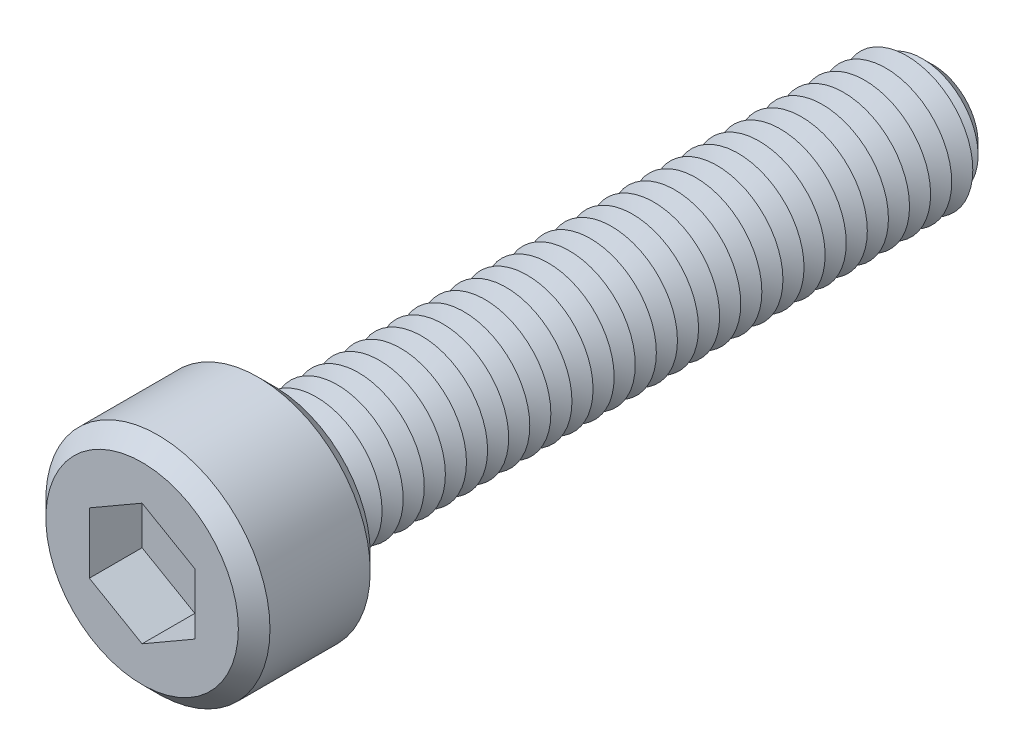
ISO-10303-21;
HEADER;
FILE_DESCRIPTION(('STEP AP214'),'2;1');
FILE_NAME('part.step','',(''),(''),'','','');
FILE_SCHEMA(('AUTOMOTIVE_DESIGN { 1 0 10303 214 1 1 1 1 }'));
ENDSEC;
DATA;
#1=APPLICATION_CONTEXT('core data for automotive mechanical design processes');
#2=APPLICATION_PROTOCOL_DEFINITION('international standard','automotive_design',2000,#1);
#3=PRODUCT_CONTEXT('',#1,'mechanical');
#4=PRODUCT('Part','Part','',(#3));
#5=PRODUCT_RELATED_PRODUCT_CATEGORY('part','',(#4));
#6=PRODUCT_DEFINITION_FORMATION('','',#4);
#7=PRODUCT_DEFINITION_CONTEXT('part definition',#1,'design');
#8=PRODUCT_DEFINITION('design','',#6,#7);
#9=PRODUCT_DEFINITION_SHAPE('','',#8);
#10=(LENGTH_UNIT() NAMED_UNIT(*) SI_UNIT(.MILLI.,.METRE.));
#11=(NAMED_UNIT(*) PLANE_ANGLE_UNIT() SI_UNIT($,.RADIAN.));
#12=(NAMED_UNIT(*) SI_UNIT($,.STERADIAN.) SOLID_ANGLE_UNIT());
#13=UNCERTAINTY_MEASURE_WITH_UNIT(LENGTH_MEASURE(1.E-05),#10,'distance_accuracy_value','');
#14=(GEOMETRIC_REPRESENTATION_CONTEXT(3) GLOBAL_UNCERTAINTY_ASSIGNED_CONTEXT((#13)) GLOBAL_UNIT_ASSIGNED_CONTEXT((#10,
#11,#12)) REPRESENTATION_CONTEXT('',''));
#15=CARTESIAN_POINT('',(0.,0.,0.));
#16=DIRECTION('',(0.,0.,1.));
#17=DIRECTION('',(1.,0.,0.));
#18=AXIS2_PLACEMENT_3D('',#15,#16,#17);
#19=CARTESIAN_POINT('',(0.,0.,5.));
#20=DIRECTION('',(0.,0.,-1.));
#21=DIRECTION('',(-1.,0.,0.));
#22=AXIS2_PLACEMENT_3D('',#19,#20,#21);
#23=CYLINDRICAL_SURFACE('',#22,4.25);
#24=CARTESIAN_POINT('',(0.,0.,0.599999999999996));
#25=DIRECTION('',(0.,0.,1.));
#26=DIRECTION('',(1.,0.,0.));
#27=AXIS2_PLACEMENT_3D('',#24,#25,#26);
#28=CIRCLE('',#27,4.25);
#29=CARTESIAN_POINT('',(4.25,0.,0.599999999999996));
#30=VERTEX_POINT('',#29);
#31=EDGE_CURVE('E425',#30,#30,#28,.T.);
#32=ORIENTED_EDGE('',*,*,#31,.T.);
#33=EDGE_LOOP('',(#32));
#34=FACE_BOUND('',#33,.T.);
#35=CARTESIAN_POINT('',(0.,0.,4.4));
#36=DIRECTION('',(0.,0.,1.));
#37=DIRECTION('',(1.,0.,0.));
#38=AXIS2_PLACEMENT_3D('',#35,#36,#37);
#39=CIRCLE('',#38,4.25);
#40=CARTESIAN_POINT('',(4.25,0.,4.4));
#41=VERTEX_POINT('',#40);
#42=EDGE_CURVE('E418',#41,#41,#39,.F.);
#43=ORIENTED_EDGE('',*,*,#42,.T.);
#44=EDGE_LOOP('',(#43));
#45=FACE_BOUND('',#44,.T.);
#46=ADVANCED_FACE('F39',(#34,#45),#23,.T.);
#47=CARTESIAN_POINT('',(0.,0.,5.));
#48=DIRECTION('',(0.,0.,1.));
#49=DIRECTION('',(1.,0.,0.));
#50=AXIS2_PLACEMENT_3D('',#47,#48,#49);
#51=PLANE('',#50);
#52=CARTESIAN_POINT('',(0.,0.,5.));
#53=DIRECTION('',(0.,0.,1.));
#54=DIRECTION('',(1.,0.,0.));
#55=AXIS2_PLACEMENT_3D('',#52,#53,#54);
#56=CIRCLE('',#55,3.65);
#57=CARTESIAN_POINT('',(3.65,0.,5.));
#58=VERTEX_POINT('',#57);
#59=EDGE_CURVE('E11',#58,#58,#56,.T.);
#60=ORIENTED_EDGE('',*,*,#59,.T.);
#61=EDGE_LOOP('',(#60));
#62=FACE_BOUND('',#61,.T.);
#63=DIRECTION('',(-0.866025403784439,0.5,0.));
#64=VECTOR('',#63,1.);
#65=CARTESIAN_POINT('',(2.,1.15470053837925,5.));
#66=LINE('',#65,#64);
#67=CARTESIAN_POINT('',(2.,1.15470053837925,5.));
#68=VERTEX_POINT('',#67);
#69=CARTESIAN_POINT('',(0.,2.3094010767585,5.));
#70=VERTEX_POINT('',#69);
#71=EDGE_CURVE('E55',#68,#70,#66,.T.);
#72=ORIENTED_EDGE('',*,*,#71,.F.);
#73=DIRECTION('',(0.,1.,0.));
#74=VECTOR('',#73,1.);
#75=CARTESIAN_POINT('',(2.,-1.15470053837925,5.));
#76=LINE('',#75,#74);
#77=CARTESIAN_POINT('',(2.,-1.15470053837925,5.));
#78=VERTEX_POINT('',#77);
#79=EDGE_CURVE('E151',#78,#68,#76,.T.);
#80=ORIENTED_EDGE('',*,*,#79,.F.);
#81=DIRECTION('',(0.866025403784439,0.5,0.));
#82=VECTOR('',#81,1.);
#83=CARTESIAN_POINT('',(0.,-2.3094010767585,5.));
#84=LINE('',#83,#82);
#85=CARTESIAN_POINT('',(0.,-2.3094010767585,5.));
#86=VERTEX_POINT('',#85);
#87=EDGE_CURVE('E148',#86,#78,#84,.T.);
#88=ORIENTED_EDGE('',*,*,#87,.F.);
#89=DIRECTION('',(0.866025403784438,-0.5,0.));
#90=VECTOR('',#89,1.);
#91=CARTESIAN_POINT('',(-2.,-1.15470053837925,5.));
#92=LINE('',#91,#90);
#93=CARTESIAN_POINT('',(-2.,-1.15470053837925,5.));
#94=VERTEX_POINT('',#93);
#95=EDGE_CURVE('E103',#94,#86,#92,.T.);
#96=ORIENTED_EDGE('',*,*,#95,.F.);
#97=DIRECTION('',(0.,-1.,0.));
#98=VECTOR('',#97,1.);
#99=CARTESIAN_POINT('',(-2.,1.15470053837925,5.));
#100=LINE('',#99,#98);
#101=CARTESIAN_POINT('',(-2.,1.15470053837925,5.));
#102=VERTEX_POINT('',#101);
#103=EDGE_CURVE('E142',#102,#94,#100,.T.);
#104=ORIENTED_EDGE('',*,*,#103,.F.);
#105=DIRECTION('',(-0.866025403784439,-0.5,0.));
#106=VECTOR('',#105,1.);
#107=CARTESIAN_POINT('',(0.,2.3094010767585,5.));
#108=LINE('',#107,#106);
#109=EDGE_CURVE('E137',#70,#102,#108,.T.);
#110=ORIENTED_EDGE('',*,*,#109,.F.);
#111=EDGE_LOOP('',(#72,#80,#88,#96,#104,#110));
#112=FACE_BOUND('',#111,.T.);
#113=ADVANCED_FACE('F444',(#62,#112),#51,.T.);
#114=CARTESIAN_POINT('',(0.,0.,0.));
#115=DIRECTION('',(0.,0.,1.));
#116=DIRECTION('',(1.,0.,0.));
#117=AXIS2_PLACEMENT_3D('',#114,#115,#116);
#118=PLANE('',#117);
#119=CARTESIAN_POINT('',(0.,0.,0.));
#120=DIRECTION('',(0.,0.,1.));
#121=DIRECTION('',(1.,0.,0.));
#122=AXIS2_PLACEMENT_3D('',#119,#120,#121);
#123=CIRCLE('',#122,3.65);
#124=CARTESIAN_POINT('',(3.65,0.,0.));
#125=VERTEX_POINT('',#124);
#126=EDGE_CURVE('E48',#125,#125,#123,.F.);
#127=ORIENTED_EDGE('',*,*,#126,.T.);
#128=EDGE_LOOP('',(#127));
#129=FACE_BOUND('',#128,.T.);
#130=CARTESIAN_POINT('',(0.,0.,0.));
#131=DIRECTION('',(0.,0.,1.));
#132=DIRECTION('',(1.,0.,0.));
#133=AXIS2_PLACEMENT_3D('',#130,#131,#132);
#134=CIRCLE('',#133,2.5);
#135=CARTESIAN_POINT('',(2.5,0.,0.));
#136=VERTEX_POINT('',#135);
#137=EDGE_CURVE('E410',#136,#136,#134,.T.);
#138=ORIENTED_EDGE('',*,*,#137,.T.);
#139=EDGE_LOOP('',(#138));
#140=FACE_BOUND('',#139,.T.);
#141=ADVANCED_FACE('F433',(#129,#140),#118,.F.);
#142=CARTESIAN_POINT('',(0.,0.,0.));
#143=DIRECTION('',(0.,0.,1.));
#144=DIRECTION('',(1.,0.,0.));
#145=AXIS2_PLACEMENT_3D('',#142,#143,#144);
#146=CONICAL_SURFACE('',#145,2.5,1.0471975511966);
#147=CARTESIAN_POINT('',(0.,0.,-0.4));
#148=DIRECTION('',(0.,0.,1.));
#149=DIRECTION('',(1.,0.,0.));
#150=AXIS2_PLACEMENT_3D('',#147,#148,#149);
#151=CIRCLE('',#150,1.80717967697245);
#152=CARTESIAN_POINT('',(1.80717967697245,0.,-0.4));
#153=VERTEX_POINT('',#152);
#154=EDGE_CURVE('E406',#153,#153,#151,.T.);
#155=ORIENTED_EDGE('',*,*,#154,.T.);
#156=EDGE_LOOP('',(#155));
#157=FACE_BOUND('',#156,.T.);
#158=ORIENTED_EDGE('',*,*,#137,.F.);
#159=EDGE_LOOP('',(#158));
#160=FACE_BOUND('',#159,.T.);
#161=ADVANCED_FACE('F740',(#157,#160),#146,.T.);
#162=CARTESIAN_POINT('',(0.,0.,-0.4));
#163=DIRECTION('',(0.,0.,-1.));
#164=DIRECTION('',(-1.,0.,0.));
#165=AXIS2_PLACEMENT_3D('',#162,#163,#164);
#166=CONICAL_SURFACE('',#165,1.80717967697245,1.0471975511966);
#167=CARTESIAN_POINT('',(0.,0.,-0.8));
#168=DIRECTION('',(0.,0.,1.));
#169=DIRECTION('',(1.,0.,0.));
#170=AXIS2_PLACEMENT_3D('',#167,#168,#169);
#171=CIRCLE('',#170,2.5);
#172=CARTESIAN_POINT('',(2.5,0.,-0.8));
#173=VERTEX_POINT('',#172);
#174=EDGE_CURVE('E402',#173,#173,#171,.T.);
#175=ORIENTED_EDGE('',*,*,#174,.T.);
#176=EDGE_LOOP('',(#175));
#177=FACE_BOUND('',#176,.T.);
#178=ORIENTED_EDGE('',*,*,#154,.F.);
#179=EDGE_LOOP('',(#178));
#180=FACE_BOUND('',#179,.T.);
#181=ADVANCED_FACE('F736',(#177,#180),#166,.T.);
#182=CARTESIAN_POINT('',(0.,0.,-0.8));
#183=DIRECTION('',(0.,0.,1.));
#184=DIRECTION('',(1.,0.,0.));
#185=AXIS2_PLACEMENT_3D('',#182,#183,#184);
#186=CONICAL_SURFACE('',#185,2.5,1.0471975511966);
#187=CARTESIAN_POINT('',(0.,0.,-1.2));
#188=DIRECTION('',(0.,0.,1.));
#189=DIRECTION('',(1.,0.,0.));
#190=AXIS2_PLACEMENT_3D('',#187,#188,#189);
#191=CIRCLE('',#190,1.80717967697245);
#192=CARTESIAN_POINT('',(1.80717967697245,0.,-1.2));
#193=VERTEX_POINT('',#192);
#194=EDGE_CURVE('E398',#193,#193,#191,.T.);
#195=ORIENTED_EDGE('',*,*,#194,.T.);
#196=EDGE_LOOP('',(#195));
#197=FACE_BOUND('',#196,.T.);
#198=ORIENTED_EDGE('',*,*,#174,.F.);
#199=EDGE_LOOP('',(#198));
#200=FACE_BOUND('',#199,.T.);
#201=ADVANCED_FACE('F732',(#197,#200),#186,.T.);
#202=CARTESIAN_POINT('',(0.,0.,-1.2));
#203=DIRECTION('',(0.,0.,-1.));
#204=DIRECTION('',(-1.,0.,0.));
#205=AXIS2_PLACEMENT_3D('',#202,#203,#204);
#206=CONICAL_SURFACE('',#205,1.80717967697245,1.0471975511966);
#207=CARTESIAN_POINT('',(0.,0.,-1.6));
#208=DIRECTION('',(0.,0.,1.));
#209=DIRECTION('',(1.,0.,0.));
#210=AXIS2_PLACEMENT_3D('',#207,#208,#209);
#211=CIRCLE('',#210,2.5);
#212=CARTESIAN_POINT('',(2.5,0.,-1.6));
#213=VERTEX_POINT('',#212);
#214=EDGE_CURVE('E394',#213,#213,#211,.T.);
#215=ORIENTED_EDGE('',*,*,#214,.T.);
#216=EDGE_LOOP('',(#215));
#217=FACE_BOUND('',#216,.T.);
#218=ORIENTED_EDGE('',*,*,#194,.F.);
#219=EDGE_LOOP('',(#218));
#220=FACE_BOUND('',#219,.T.);
#221=ADVANCED_FACE('F728',(#217,#220),#206,.T.);
#222=CARTESIAN_POINT('',(0.,0.,-1.6));
#223=DIRECTION('',(0.,0.,1.));
#224=DIRECTION('',(1.,0.,0.));
#225=AXIS2_PLACEMENT_3D('',#222,#223,#224);
#226=CONICAL_SURFACE('',#225,2.5,1.0471975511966);
#227=CARTESIAN_POINT('',(0.,0.,-2.));
#228=DIRECTION('',(0.,0.,1.));
#229=DIRECTION('',(1.,0.,0.));
#230=AXIS2_PLACEMENT_3D('',#227,#228,#229);
#231=CIRCLE('',#230,1.80717967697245);
#232=CARTESIAN_POINT('',(1.80717967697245,0.,-2.));
#233=VERTEX_POINT('',#232);
#234=EDGE_CURVE('E390',#233,#233,#231,.T.);
#235=ORIENTED_EDGE('',*,*,#234,.T.);
#236=EDGE_LOOP('',(#235));
#237=FACE_BOUND('',#236,.T.);
#238=ORIENTED_EDGE('',*,*,#214,.F.);
#239=EDGE_LOOP('',(#238));
#240=FACE_BOUND('',#239,.T.);
#241=ADVANCED_FACE('F724',(#237,#240),#226,.T.);
#242=CARTESIAN_POINT('',(0.,0.,-2.));
#243=DIRECTION('',(0.,0.,-1.));
#244=DIRECTION('',(-1.,0.,0.));
#245=AXIS2_PLACEMENT_3D('',#242,#243,#244);
#246=CONICAL_SURFACE('',#245,1.80717967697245,1.0471975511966);
#247=CARTESIAN_POINT('',(0.,0.,-2.4));
#248=DIRECTION('',(0.,0.,1.));
#249=DIRECTION('',(1.,0.,0.));
#250=AXIS2_PLACEMENT_3D('',#247,#248,#249);
#251=CIRCLE('',#250,2.5);
#252=CARTESIAN_POINT('',(2.5,0.,-2.4));
#253=VERTEX_POINT('',#252);
#254=EDGE_CURVE('E386',#253,#253,#251,.T.);
#255=ORIENTED_EDGE('',*,*,#254,.T.);
#256=EDGE_LOOP('',(#255));
#257=FACE_BOUND('',#256,.T.);
#258=ORIENTED_EDGE('',*,*,#234,.F.);
#259=EDGE_LOOP('',(#258));
#260=FACE_BOUND('',#259,.T.);
#261=ADVANCED_FACE('F720',(#257,#260),#246,.T.);
#262=CARTESIAN_POINT('',(0.,0.,-2.4));
#263=DIRECTION('',(0.,0.,1.));
#264=DIRECTION('',(1.,0.,0.));
#265=AXIS2_PLACEMENT_3D('',#262,#263,#264);
#266=CONICAL_SURFACE('',#265,2.5,1.0471975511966);
#267=CARTESIAN_POINT('',(0.,0.,-2.8));
#268=DIRECTION('',(0.,0.,1.));
#269=DIRECTION('',(1.,0.,0.));
#270=AXIS2_PLACEMENT_3D('',#267,#268,#269);
#271=CIRCLE('',#270,1.80717967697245);
#272=CARTESIAN_POINT('',(1.80717967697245,0.,-2.8));
#273=VERTEX_POINT('',#272);
#274=EDGE_CURVE('E382',#273,#273,#271,.T.);
#275=ORIENTED_EDGE('',*,*,#274,.T.);
#276=EDGE_LOOP('',(#275));
#277=FACE_BOUND('',#276,.T.);
#278=ORIENTED_EDGE('',*,*,#254,.F.);
#279=EDGE_LOOP('',(#278));
#280=FACE_BOUND('',#279,.T.);
#281=ADVANCED_FACE('F716',(#277,#280),#266,.T.);
#282=CARTESIAN_POINT('',(0.,0.,-2.8));
#283=DIRECTION('',(0.,0.,-1.));
#284=DIRECTION('',(-1.,0.,0.));
#285=AXIS2_PLACEMENT_3D('',#282,#283,#284);
#286=CONICAL_SURFACE('',#285,1.80717967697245,1.0471975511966);
#287=CARTESIAN_POINT('',(0.,0.,-3.2));
#288=DIRECTION('',(0.,0.,1.));
#289=DIRECTION('',(1.,0.,0.));
#290=AXIS2_PLACEMENT_3D('',#287,#288,#289);
#291=CIRCLE('',#290,2.5);
#292=CARTESIAN_POINT('',(2.5,0.,-3.2));
#293=VERTEX_POINT('',#292);
#294=EDGE_CURVE('E378',#293,#293,#291,.T.);
#295=ORIENTED_EDGE('',*,*,#294,.T.);
#296=EDGE_LOOP('',(#295));
#297=FACE_BOUND('',#296,.T.);
#298=ORIENTED_EDGE('',*,*,#274,.F.);
#299=EDGE_LOOP('',(#298));
#300=FACE_BOUND('',#299,.T.);
#301=ADVANCED_FACE('F712',(#297,#300),#286,.T.);
#302=CARTESIAN_POINT('',(0.,0.,-3.2));
#303=DIRECTION('',(0.,0.,1.));
#304=DIRECTION('',(1.,0.,0.));
#305=AXIS2_PLACEMENT_3D('',#302,#303,#304);
#306=CONICAL_SURFACE('',#305,2.5,1.0471975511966);
#307=CARTESIAN_POINT('',(0.,0.,-3.6));
#308=DIRECTION('',(0.,0.,1.));
#309=DIRECTION('',(1.,0.,0.));
#310=AXIS2_PLACEMENT_3D('',#307,#308,#309);
#311=CIRCLE('',#310,1.80717967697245);
#312=CARTESIAN_POINT('',(1.80717967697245,0.,-3.6));
#313=VERTEX_POINT('',#312);
#314=EDGE_CURVE('E374',#313,#313,#311,.T.);
#315=ORIENTED_EDGE('',*,*,#314,.T.);
#316=EDGE_LOOP('',(#315));
#317=FACE_BOUND('',#316,.T.);
#318=ORIENTED_EDGE('',*,*,#294,.F.);
#319=EDGE_LOOP('',(#318));
#320=FACE_BOUND('',#319,.T.);
#321=ADVANCED_FACE('F708',(#317,#320),#306,.T.);
#322=CARTESIAN_POINT('',(0.,0.,-3.6));
#323=DIRECTION('',(0.,0.,-1.));
#324=DIRECTION('',(-1.,0.,0.));
#325=AXIS2_PLACEMENT_3D('',#322,#323,#324);
#326=CONICAL_SURFACE('',#325,1.80717967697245,1.0471975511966);
#327=CARTESIAN_POINT('',(0.,0.,-4.));
#328=DIRECTION('',(0.,0.,1.));
#329=DIRECTION('',(1.,0.,0.));
#330=AXIS2_PLACEMENT_3D('',#327,#328,#329);
#331=CIRCLE('',#330,2.5);
#332=CARTESIAN_POINT('',(2.5,0.,-4.));
#333=VERTEX_POINT('',#332);
#334=EDGE_CURVE('E370',#333,#333,#331,.T.);
#335=ORIENTED_EDGE('',*,*,#334,.T.);
#336=EDGE_LOOP('',(#335));
#337=FACE_BOUND('',#336,.T.);
#338=ORIENTED_EDGE('',*,*,#314,.F.);
#339=EDGE_LOOP('',(#338));
#340=FACE_BOUND('',#339,.T.);
#341=ADVANCED_FACE('F704',(#337,#340),#326,.T.);
#342=CARTESIAN_POINT('',(0.,0.,-4.));
#343=DIRECTION('',(0.,0.,1.));
#344=DIRECTION('',(1.,0.,0.));
#345=AXIS2_PLACEMENT_3D('',#342,#343,#344);
#346=CONICAL_SURFACE('',#345,2.5,1.0471975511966);
#347=CARTESIAN_POINT('',(0.,0.,-4.4));
#348=DIRECTION('',(0.,0.,1.));
#349=DIRECTION('',(1.,0.,0.));
#350=AXIS2_PLACEMENT_3D('',#347,#348,#349);
#351=CIRCLE('',#350,1.80717967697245);
#352=CARTESIAN_POINT('',(1.80717967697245,0.,-4.4));
#353=VERTEX_POINT('',#352);
#354=EDGE_CURVE('E366',#353,#353,#351,.T.);
#355=ORIENTED_EDGE('',*,*,#354,.T.);
#356=EDGE_LOOP('',(#355));
#357=FACE_BOUND('',#356,.T.);
#358=ORIENTED_EDGE('',*,*,#334,.F.);
#359=EDGE_LOOP('',(#358));
#360=FACE_BOUND('',#359,.T.);
#361=ADVANCED_FACE('F700',(#357,#360),#346,.T.);
#362=CARTESIAN_POINT('',(0.,0.,-4.4));
#363=DIRECTION('',(0.,0.,-1.));
#364=DIRECTION('',(-1.,0.,0.));
#365=AXIS2_PLACEMENT_3D('',#362,#363,#364);
#366=CONICAL_SURFACE('',#365,1.80717967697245,1.0471975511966);
#367=CARTESIAN_POINT('',(0.,0.,-4.8));
#368=DIRECTION('',(0.,0.,1.));
#369=DIRECTION('',(1.,0.,0.));
#370=AXIS2_PLACEMENT_3D('',#367,#368,#369);
#371=CIRCLE('',#370,2.5);
#372=CARTESIAN_POINT('',(2.5,0.,-4.8));
#373=VERTEX_POINT('',#372);
#374=EDGE_CURVE('E362',#373,#373,#371,.T.);
#375=ORIENTED_EDGE('',*,*,#374,.T.);
#376=EDGE_LOOP('',(#375));
#377=FACE_BOUND('',#376,.T.);
#378=ORIENTED_EDGE('',*,*,#354,.F.);
#379=EDGE_LOOP('',(#378));
#380=FACE_BOUND('',#379,.T.);
#381=ADVANCED_FACE('F696',(#377,#380),#366,.T.);
#382=CARTESIAN_POINT('',(0.,0.,-4.8));
#383=DIRECTION('',(0.,0.,1.));
#384=DIRECTION('',(1.,0.,0.));
#385=AXIS2_PLACEMENT_3D('',#382,#383,#384);
#386=CONICAL_SURFACE('',#385,2.5,1.0471975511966);
#387=CARTESIAN_POINT('',(0.,0.,-5.2));
#388=DIRECTION('',(0.,0.,1.));
#389=DIRECTION('',(1.,0.,0.));
#390=AXIS2_PLACEMENT_3D('',#387,#388,#389);
#391=CIRCLE('',#390,1.80717967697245);
#392=CARTESIAN_POINT('',(1.80717967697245,0.,-5.2));
#393=VERTEX_POINT('',#392);
#394=EDGE_CURVE('E358',#393,#393,#391,.T.);
#395=ORIENTED_EDGE('',*,*,#394,.T.);
#396=EDGE_LOOP('',(#395));
#397=FACE_BOUND('',#396,.T.);
#398=ORIENTED_EDGE('',*,*,#374,.F.);
#399=EDGE_LOOP('',(#398));
#400=FACE_BOUND('',#399,.T.);
#401=ADVANCED_FACE('F692',(#397,#400),#386,.T.);
#402=CARTESIAN_POINT('',(0.,0.,-5.2));
#403=DIRECTION('',(0.,0.,-1.));
#404=DIRECTION('',(-1.,0.,0.));
#405=AXIS2_PLACEMENT_3D('',#402,#403,#404);
#406=CONICAL_SURFACE('',#405,1.80717967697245,1.0471975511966);
#407=CARTESIAN_POINT('',(0.,0.,-5.6));
#408=DIRECTION('',(0.,0.,1.));
#409=DIRECTION('',(1.,0.,0.));
#410=AXIS2_PLACEMENT_3D('',#407,#408,#409);
#411=CIRCLE('',#410,2.5);
#412=CARTESIAN_POINT('',(2.5,0.,-5.6));
#413=VERTEX_POINT('',#412);
#414=EDGE_CURVE('E354',#413,#413,#411,.T.);
#415=ORIENTED_EDGE('',*,*,#414,.T.);
#416=EDGE_LOOP('',(#415));
#417=FACE_BOUND('',#416,.T.);
#418=ORIENTED_EDGE('',*,*,#394,.F.);
#419=EDGE_LOOP('',(#418));
#420=FACE_BOUND('',#419,.T.);
#421=ADVANCED_FACE('F688',(#417,#420),#406,.T.);
#422=CARTESIAN_POINT('',(0.,0.,-5.6));
#423=DIRECTION('',(0.,0.,1.));
#424=DIRECTION('',(1.,0.,0.));
#425=AXIS2_PLACEMENT_3D('',#422,#423,#424);
#426=CONICAL_SURFACE('',#425,2.5,1.0471975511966);
#427=CARTESIAN_POINT('',(0.,0.,-6.));
#428=DIRECTION('',(0.,0.,1.));
#429=DIRECTION('',(1.,0.,0.));
#430=AXIS2_PLACEMENT_3D('',#427,#428,#429);
#431=CIRCLE('',#430,1.80717967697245);
#432=CARTESIAN_POINT('',(1.80717967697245,0.,-6.));
#433=VERTEX_POINT('',#432);
#434=EDGE_CURVE('E350',#433,#433,#431,.T.);
#435=ORIENTED_EDGE('',*,*,#434,.T.);
#436=EDGE_LOOP('',(#435));
#437=FACE_BOUND('',#436,.T.);
#438=ORIENTED_EDGE('',*,*,#414,.F.);
#439=EDGE_LOOP('',(#438));
#440=FACE_BOUND('',#439,.T.);
#441=ADVANCED_FACE('F684',(#437,#440),#426,.T.);
#442=CARTESIAN_POINT('',(0.,0.,-6.));
#443=DIRECTION('',(0.,0.,-1.));
#444=DIRECTION('',(-1.,0.,0.));
#445=AXIS2_PLACEMENT_3D('',#442,#443,#444);
#446=CONICAL_SURFACE('',#445,1.80717967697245,1.0471975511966);
#447=CARTESIAN_POINT('',(0.,0.,-6.4));
#448=DIRECTION('',(0.,0.,1.));
#449=DIRECTION('',(1.,0.,0.));
#450=AXIS2_PLACEMENT_3D('',#447,#448,#449);
#451=CIRCLE('',#450,2.5);
#452=CARTESIAN_POINT('',(2.5,0.,-6.4));
#453=VERTEX_POINT('',#452);
#454=EDGE_CURVE('E346',#453,#453,#451,.T.);
#455=ORIENTED_EDGE('',*,*,#454,.T.);
#456=EDGE_LOOP('',(#455));
#457=FACE_BOUND('',#456,.T.);
#458=ORIENTED_EDGE('',*,*,#434,.F.);
#459=EDGE_LOOP('',(#458));
#460=FACE_BOUND('',#459,.T.);
#461=ADVANCED_FACE('F680',(#457,#460),#446,.T.);
#462=CARTESIAN_POINT('',(0.,0.,-6.4));
#463=DIRECTION('',(0.,0.,1.));
#464=DIRECTION('',(1.,0.,0.));
#465=AXIS2_PLACEMENT_3D('',#462,#463,#464);
#466=CONICAL_SURFACE('',#465,2.5,1.0471975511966);
#467=CARTESIAN_POINT('',(0.,0.,-6.8));
#468=DIRECTION('',(0.,0.,1.));
#469=DIRECTION('',(1.,0.,0.));
#470=AXIS2_PLACEMENT_3D('',#467,#468,#469);
#471=CIRCLE('',#470,1.80717967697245);
#472=CARTESIAN_POINT('',(1.80717967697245,0.,-6.8));
#473=VERTEX_POINT('',#472);
#474=EDGE_CURVE('E342',#473,#473,#471,.T.);
#475=ORIENTED_EDGE('',*,*,#474,.T.);
#476=EDGE_LOOP('',(#475));
#477=FACE_BOUND('',#476,.T.);
#478=ORIENTED_EDGE('',*,*,#454,.F.);
#479=EDGE_LOOP('',(#478));
#480=FACE_BOUND('',#479,.T.);
#481=ADVANCED_FACE('F676',(#477,#480),#466,.T.);
#482=CARTESIAN_POINT('',(0.,0.,-6.8));
#483=DIRECTION('',(0.,0.,-1.));
#484=DIRECTION('',(-1.,0.,0.));
#485=AXIS2_PLACEMENT_3D('',#482,#483,#484);
#486=CONICAL_SURFACE('',#485,1.80717967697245,1.0471975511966);
#487=CARTESIAN_POINT('',(0.,0.,-7.2));
#488=DIRECTION('',(0.,0.,1.));
#489=DIRECTION('',(1.,0.,0.));
#490=AXIS2_PLACEMENT_3D('',#487,#488,#489);
#491=CIRCLE('',#490,2.5);
#492=CARTESIAN_POINT('',(2.5,0.,-7.2));
#493=VERTEX_POINT('',#492);
#494=EDGE_CURVE('E338',#493,#493,#491,.T.);
#495=ORIENTED_EDGE('',*,*,#494,.T.);
#496=EDGE_LOOP('',(#495));
#497=FACE_BOUND('',#496,.T.);
#498=ORIENTED_EDGE('',*,*,#474,.F.);
#499=EDGE_LOOP('',(#498));
#500=FACE_BOUND('',#499,.T.);
#501=ADVANCED_FACE('F672',(#497,#500),#486,.T.);
#502=CARTESIAN_POINT('',(0.,0.,-7.2));
#503=DIRECTION('',(0.,0.,1.));
#504=DIRECTION('',(1.,0.,0.));
#505=AXIS2_PLACEMENT_3D('',#502,#503,#504);
#506=CONICAL_SURFACE('',#505,2.5,1.0471975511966);
#507=CARTESIAN_POINT('',(0.,0.,-7.6));
#508=DIRECTION('',(0.,0.,1.));
#509=DIRECTION('',(1.,0.,0.));
#510=AXIS2_PLACEMENT_3D('',#507,#508,#509);
#511=CIRCLE('',#510,1.80717967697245);
#512=CARTESIAN_POINT('',(1.80717967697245,0.,-7.6));
#513=VERTEX_POINT('',#512);
#514=EDGE_CURVE('E334',#513,#513,#511,.T.);
#515=ORIENTED_EDGE('',*,*,#514,.T.);
#516=EDGE_LOOP('',(#515));
#517=FACE_BOUND('',#516,.T.);
#518=ORIENTED_EDGE('',*,*,#494,.F.);
#519=EDGE_LOOP('',(#518));
#520=FACE_BOUND('',#519,.T.);
#521=ADVANCED_FACE('F668',(#517,#520),#506,.T.);
#522=CARTESIAN_POINT('',(0.,0.,-7.6));
#523=DIRECTION('',(0.,0.,-1.));
#524=DIRECTION('',(-1.,0.,0.));
#525=AXIS2_PLACEMENT_3D('',#522,#523,#524);
#526=CONICAL_SURFACE('',#525,1.80717967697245,1.0471975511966);
#527=CARTESIAN_POINT('',(0.,0.,-8.));
#528=DIRECTION('',(0.,0.,1.));
#529=DIRECTION('',(1.,0.,0.));
#530=AXIS2_PLACEMENT_3D('',#527,#528,#529);
#531=CIRCLE('',#530,2.5);
#532=CARTESIAN_POINT('',(2.5,0.,-8.));
#533=VERTEX_POINT('',#532);
#534=EDGE_CURVE('E330',#533,#533,#531,.T.);
#535=ORIENTED_EDGE('',*,*,#534,.T.);
#536=EDGE_LOOP('',(#535));
#537=FACE_BOUND('',#536,.T.);
#538=ORIENTED_EDGE('',*,*,#514,.F.);
#539=EDGE_LOOP('',(#538));
#540=FACE_BOUND('',#539,.T.);
#541=ADVANCED_FACE('F664',(#537,#540),#526,.T.);
#542=CARTESIAN_POINT('',(0.,0.,-8.));
#543=DIRECTION('',(0.,0.,1.));
#544=DIRECTION('',(1.,0.,0.));
#545=AXIS2_PLACEMENT_3D('',#542,#543,#544);
#546=CONICAL_SURFACE('',#545,2.5,1.0471975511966);
#547=CARTESIAN_POINT('',(0.,0.,-8.4));
#548=DIRECTION('',(0.,0.,1.));
#549=DIRECTION('',(1.,0.,0.));
#550=AXIS2_PLACEMENT_3D('',#547,#548,#549);
#551=CIRCLE('',#550,1.80717967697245);
#552=CARTESIAN_POINT('',(1.80717967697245,0.,-8.4));
#553=VERTEX_POINT('',#552);
#554=EDGE_CURVE('E326',#553,#553,#551,.T.);
#555=ORIENTED_EDGE('',*,*,#554,.T.);
#556=EDGE_LOOP('',(#555));
#557=FACE_BOUND('',#556,.T.);
#558=ORIENTED_EDGE('',*,*,#534,.F.);
#559=EDGE_LOOP('',(#558));
#560=FACE_BOUND('',#559,.T.);
#561=ADVANCED_FACE('F660',(#557,#560),#546,.T.);
#562=CARTESIAN_POINT('',(0.,0.,-8.4));
#563=DIRECTION('',(0.,0.,-1.));
#564=DIRECTION('',(-1.,0.,0.));
#565=AXIS2_PLACEMENT_3D('',#562,#563,#564);
#566=CONICAL_SURFACE('',#565,1.80717967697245,1.0471975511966);
#567=CARTESIAN_POINT('',(0.,0.,-8.8));
#568=DIRECTION('',(0.,0.,1.));
#569=DIRECTION('',(1.,0.,0.));
#570=AXIS2_PLACEMENT_3D('',#567,#568,#569);
#571=CIRCLE('',#570,2.5);
#572=CARTESIAN_POINT('',(2.5,0.,-8.8));
#573=VERTEX_POINT('',#572);
#574=EDGE_CURVE('E322',#573,#573,#571,.T.);
#575=ORIENTED_EDGE('',*,*,#574,.T.);
#576=EDGE_LOOP('',(#575));
#577=FACE_BOUND('',#576,.T.);
#578=ORIENTED_EDGE('',*,*,#554,.F.);
#579=EDGE_LOOP('',(#578));
#580=FACE_BOUND('',#579,.T.);
#581=ADVANCED_FACE('F656',(#577,#580),#566,.T.);
#582=CARTESIAN_POINT('',(0.,0.,-8.8));
#583=DIRECTION('',(0.,0.,1.));
#584=DIRECTION('',(1.,0.,0.));
#585=AXIS2_PLACEMENT_3D('',#582,#583,#584);
#586=CONICAL_SURFACE('',#585,2.5,1.0471975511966);
#587=CARTESIAN_POINT('',(0.,0.,-9.2));
#588=DIRECTION('',(0.,0.,1.));
#589=DIRECTION('',(1.,0.,0.));
#590=AXIS2_PLACEMENT_3D('',#587,#588,#589);
#591=CIRCLE('',#590,1.80717967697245);
#592=CARTESIAN_POINT('',(1.80717967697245,0.,-9.2));
#593=VERTEX_POINT('',#592);
#594=EDGE_CURVE('E318',#593,#593,#591,.T.);
#595=ORIENTED_EDGE('',*,*,#594,.T.);
#596=EDGE_LOOP('',(#595));
#597=FACE_BOUND('',#596,.T.);
#598=ORIENTED_EDGE('',*,*,#574,.F.);
#599=EDGE_LOOP('',(#598));
#600=FACE_BOUND('',#599,.T.);
#601=ADVANCED_FACE('F652',(#597,#600),#586,.T.);
#602=CARTESIAN_POINT('',(0.,0.,-9.2));
#603=DIRECTION('',(0.,0.,-1.));
#604=DIRECTION('',(-1.,0.,0.));
#605=AXIS2_PLACEMENT_3D('',#602,#603,#604);
#606=CONICAL_SURFACE('',#605,1.80717967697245,1.0471975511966);
#607=CARTESIAN_POINT('',(0.,0.,-9.6));
#608=DIRECTION('',(0.,0.,1.));
#609=DIRECTION('',(1.,0.,0.));
#610=AXIS2_PLACEMENT_3D('',#607,#608,#609);
#611=CIRCLE('',#610,2.5);
#612=CARTESIAN_POINT('',(2.5,0.,-9.6));
#613=VERTEX_POINT('',#612);
#614=EDGE_CURVE('E314',#613,#613,#611,.T.);
#615=ORIENTED_EDGE('',*,*,#614,.T.);
#616=EDGE_LOOP('',(#615));
#617=FACE_BOUND('',#616,.T.);
#618=ORIENTED_EDGE('',*,*,#594,.F.);
#619=EDGE_LOOP('',(#618));
#620=FACE_BOUND('',#619,.T.);
#621=ADVANCED_FACE('F648',(#617,#620),#606,.T.);
#622=CARTESIAN_POINT('',(0.,0.,-9.6));
#623=DIRECTION('',(0.,0.,1.));
#624=DIRECTION('',(1.,0.,0.));
#625=AXIS2_PLACEMENT_3D('',#622,#623,#624);
#626=CONICAL_SURFACE('',#625,2.5,1.0471975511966);
#627=CARTESIAN_POINT('',(0.,0.,-10.));
#628=DIRECTION('',(0.,0.,1.));
#629=DIRECTION('',(1.,0.,0.));
#630=AXIS2_PLACEMENT_3D('',#627,#628,#629);
#631=CIRCLE('',#630,1.80717967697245);
#632=CARTESIAN_POINT('',(1.80717967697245,0.,-10.));
#633=VERTEX_POINT('',#632);
#634=EDGE_CURVE('E310',#633,#633,#631,.T.);
#635=ORIENTED_EDGE('',*,*,#634,.T.);
#636=EDGE_LOOP('',(#635));
#637=FACE_BOUND('',#636,.T.);
#638=ORIENTED_EDGE('',*,*,#614,.F.);
#639=EDGE_LOOP('',(#638));
#640=FACE_BOUND('',#639,.T.);
#641=ADVANCED_FACE('F644',(#637,#640),#626,.T.);
#642=CARTESIAN_POINT('',(0.,0.,-10.));
#643=DIRECTION('',(0.,0.,-1.));
#644=DIRECTION('',(-1.,0.,0.));
#645=AXIS2_PLACEMENT_3D('',#642,#643,#644);
#646=CONICAL_SURFACE('',#645,1.80717967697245,1.0471975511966);
#647=CARTESIAN_POINT('',(0.,0.,-10.4));
#648=DIRECTION('',(0.,0.,1.));
#649=DIRECTION('',(1.,0.,0.));
#650=AXIS2_PLACEMENT_3D('',#647,#648,#649);
#651=CIRCLE('',#650,2.5);
#652=CARTESIAN_POINT('',(2.5,0.,-10.4));
#653=VERTEX_POINT('',#652);
#654=EDGE_CURVE('E306',#653,#653,#651,.T.);
#655=ORIENTED_EDGE('',*,*,#654,.T.);
#656=EDGE_LOOP('',(#655));
#657=FACE_BOUND('',#656,.T.);
#658=ORIENTED_EDGE('',*,*,#634,.F.);
#659=EDGE_LOOP('',(#658));
#660=FACE_BOUND('',#659,.T.);
#661=ADVANCED_FACE('F640',(#657,#660),#646,.T.);
#662=CARTESIAN_POINT('',(0.,0.,-10.4));
#663=DIRECTION('',(0.,0.,1.));
#664=DIRECTION('',(1.,0.,0.));
#665=AXIS2_PLACEMENT_3D('',#662,#663,#664);
#666=CONICAL_SURFACE('',#665,2.5,1.0471975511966);
#667=CARTESIAN_POINT('',(0.,0.,-10.8));
#668=DIRECTION('',(0.,0.,1.));
#669=DIRECTION('',(1.,0.,0.));
#670=AXIS2_PLACEMENT_3D('',#667,#668,#669);
#671=CIRCLE('',#670,1.80717967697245);
#672=CARTESIAN_POINT('',(1.80717967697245,0.,-10.8));
#673=VERTEX_POINT('',#672);
#674=EDGE_CURVE('E302',#673,#673,#671,.T.);
#675=ORIENTED_EDGE('',*,*,#674,.T.);
#676=EDGE_LOOP('',(#675));
#677=FACE_BOUND('',#676,.T.);
#678=ORIENTED_EDGE('',*,*,#654,.F.);
#679=EDGE_LOOP('',(#678));
#680=FACE_BOUND('',#679,.T.);
#681=ADVANCED_FACE('F636',(#677,#680),#666,.T.);
#682=CARTESIAN_POINT('',(0.,0.,-10.8));
#683=DIRECTION('',(0.,0.,-1.));
#684=DIRECTION('',(-1.,0.,0.));
#685=AXIS2_PLACEMENT_3D('',#682,#683,#684);
#686=CONICAL_SURFACE('',#685,1.80717967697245,1.0471975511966);
#687=CARTESIAN_POINT('',(0.,0.,-11.2));
#688=DIRECTION('',(0.,0.,1.));
#689=DIRECTION('',(1.,0.,0.));
#690=AXIS2_PLACEMENT_3D('',#687,#688,#689);
#691=CIRCLE('',#690,2.5);
#692=CARTESIAN_POINT('',(2.5,0.,-11.2));
#693=VERTEX_POINT('',#692);
#694=EDGE_CURVE('E298',#693,#693,#691,.T.);
#695=ORIENTED_EDGE('',*,*,#694,.T.);
#696=EDGE_LOOP('',(#695));
#697=FACE_BOUND('',#696,.T.);
#698=ORIENTED_EDGE('',*,*,#674,.F.);
#699=EDGE_LOOP('',(#698));
#700=FACE_BOUND('',#699,.T.);
#701=ADVANCED_FACE('F632',(#697,#700),#686,.T.);
#702=CARTESIAN_POINT('',(0.,0.,-11.2));
#703=DIRECTION('',(0.,0.,1.));
#704=DIRECTION('',(1.,0.,0.));
#705=AXIS2_PLACEMENT_3D('',#702,#703,#704);
#706=CONICAL_SURFACE('',#705,2.5,1.0471975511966);
#707=CARTESIAN_POINT('',(0.,0.,-11.6));
#708=DIRECTION('',(0.,0.,1.));
#709=DIRECTION('',(1.,0.,0.));
#710=AXIS2_PLACEMENT_3D('',#707,#708,#709);
#711=CIRCLE('',#710,1.80717967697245);
#712=CARTESIAN_POINT('',(1.80717967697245,0.,-11.6));
#713=VERTEX_POINT('',#712);
#714=EDGE_CURVE('E295',#713,#713,#711,.T.);
#715=ORIENTED_EDGE('',*,*,#714,.T.);
#716=EDGE_LOOP('',(#715));
#717=FACE_BOUND('',#716,.T.);
#718=ORIENTED_EDGE('',*,*,#694,.F.);
#719=EDGE_LOOP('',(#718));
#720=FACE_BOUND('',#719,.T.);
#721=ADVANCED_FACE('F628',(#717,#720),#706,.T.);
#722=CARTESIAN_POINT('',(0.,0.,-11.6));
#723=DIRECTION('',(0.,0.,-1.));
#724=DIRECTION('',(-1.,0.,0.));
#725=AXIS2_PLACEMENT_3D('',#722,#723,#724);
#726=CONICAL_SURFACE('',#725,1.80717967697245,1.0471975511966);
#727=CARTESIAN_POINT('',(0.,0.,-12.));
#728=DIRECTION('',(0.,0.,1.));
#729=DIRECTION('',(1.,0.,0.));
#730=AXIS2_PLACEMENT_3D('',#727,#728,#729);
#731=CIRCLE('',#730,2.5);
#732=CARTESIAN_POINT('',(2.5,0.,-12.));
#733=VERTEX_POINT('',#732);
#734=EDGE_CURVE('E291',#733,#733,#731,.T.);
#735=ORIENTED_EDGE('',*,*,#734,.T.);
#736=EDGE_LOOP('',(#735));
#737=FACE_BOUND('',#736,.T.);
#738=ORIENTED_EDGE('',*,*,#714,.F.);
#739=EDGE_LOOP('',(#738));
#740=FACE_BOUND('',#739,.T.);
#741=ADVANCED_FACE('F624',(#737,#740),#726,.T.);
#742=CARTESIAN_POINT('',(0.,0.,-12.));
#743=DIRECTION('',(0.,0.,1.));
#744=DIRECTION('',(1.,0.,0.));
#745=AXIS2_PLACEMENT_3D('',#742,#743,#744);
#746=CONICAL_SURFACE('',#745,2.5,1.0471975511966);
#747=CARTESIAN_POINT('',(0.,0.,-12.4));
#748=DIRECTION('',(0.,0.,1.));
#749=DIRECTION('',(1.,0.,0.));
#750=AXIS2_PLACEMENT_3D('',#747,#748,#749);
#751=CIRCLE('',#750,1.80717967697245);
#752=CARTESIAN_POINT('',(1.80717967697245,0.,-12.4));
#753=VERTEX_POINT('',#752);
#754=EDGE_CURVE('E287',#753,#753,#751,.T.);
#755=ORIENTED_EDGE('',*,*,#754,.T.);
#756=EDGE_LOOP('',(#755));
#757=FACE_BOUND('',#756,.T.);
#758=ORIENTED_EDGE('',*,*,#734,.F.);
#759=EDGE_LOOP('',(#758));
#760=FACE_BOUND('',#759,.T.);
#761=ADVANCED_FACE('F620',(#757,#760),#746,.T.);
#762=CARTESIAN_POINT('',(0.,0.,-12.4));
#763=DIRECTION('',(0.,0.,-1.));
#764=DIRECTION('',(-1.,0.,0.));
#765=AXIS2_PLACEMENT_3D('',#762,#763,#764);
#766=CONICAL_SURFACE('',#765,1.80717967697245,1.0471975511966);
#767=CARTESIAN_POINT('',(0.,0.,-12.8));
#768=DIRECTION('',(0.,0.,1.));
#769=DIRECTION('',(1.,0.,0.));
#770=AXIS2_PLACEMENT_3D('',#767,#768,#769);
#771=CIRCLE('',#770,2.5);
#772=CARTESIAN_POINT('',(2.5,0.,-12.8));
#773=VERTEX_POINT('',#772);
#774=EDGE_CURVE('E283',#773,#773,#771,.T.);
#775=ORIENTED_EDGE('',*,*,#774,.T.);
#776=EDGE_LOOP('',(#775));
#777=FACE_BOUND('',#776,.T.);
#778=ORIENTED_EDGE('',*,*,#754,.F.);
#779=EDGE_LOOP('',(#778));
#780=FACE_BOUND('',#779,.T.);
#781=ADVANCED_FACE('F616',(#777,#780),#766,.T.);
#782=CARTESIAN_POINT('',(0.,0.,-12.8));
#783=DIRECTION('',(0.,0.,1.));
#784=DIRECTION('',(1.,0.,0.));
#785=AXIS2_PLACEMENT_3D('',#782,#783,#784);
#786=CONICAL_SURFACE('',#785,2.5,1.0471975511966);
#787=CARTESIAN_POINT('',(0.,0.,-13.2));
#788=DIRECTION('',(0.,0.,1.));
#789=DIRECTION('',(1.,0.,0.));
#790=AXIS2_PLACEMENT_3D('',#787,#788,#789);
#791=CIRCLE('',#790,1.80717967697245);
#792=CARTESIAN_POINT('',(1.80717967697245,0.,-13.2));
#793=VERTEX_POINT('',#792);
#794=EDGE_CURVE('E279',#793,#793,#791,.T.);
#795=ORIENTED_EDGE('',*,*,#794,.T.);
#796=EDGE_LOOP('',(#795));
#797=FACE_BOUND('',#796,.T.);
#798=ORIENTED_EDGE('',*,*,#774,.F.);
#799=EDGE_LOOP('',(#798));
#800=FACE_BOUND('',#799,.T.);
#801=ADVANCED_FACE('F612',(#797,#800),#786,.T.);
#802=CARTESIAN_POINT('',(0.,0.,-13.2));
#803=DIRECTION('',(0.,0.,-1.));
#804=DIRECTION('',(-1.,0.,0.));
#805=AXIS2_PLACEMENT_3D('',#802,#803,#804);
#806=CONICAL_SURFACE('',#805,1.80717967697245,1.0471975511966);
#807=CARTESIAN_POINT('',(0.,0.,-13.6));
#808=DIRECTION('',(0.,0.,1.));
#809=DIRECTION('',(1.,0.,0.));
#810=AXIS2_PLACEMENT_3D('',#807,#808,#809);
#811=CIRCLE('',#810,2.5);
#812=CARTESIAN_POINT('',(2.5,0.,-13.6));
#813=VERTEX_POINT('',#812);
#814=EDGE_CURVE('E275',#813,#813,#811,.T.);
#815=ORIENTED_EDGE('',*,*,#814,.T.);
#816=EDGE_LOOP('',(#815));
#817=FACE_BOUND('',#816,.T.);
#818=ORIENTED_EDGE('',*,*,#794,.F.);
#819=EDGE_LOOP('',(#818));
#820=FACE_BOUND('',#819,.T.);
#821=ADVANCED_FACE('F608',(#817,#820),#806,.T.);
#822=CARTESIAN_POINT('',(0.,0.,-13.6));
#823=DIRECTION('',(0.,0.,1.));
#824=DIRECTION('',(1.,0.,0.));
#825=AXIS2_PLACEMENT_3D('',#822,#823,#824);
#826=CONICAL_SURFACE('',#825,2.5,1.0471975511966);
#827=CARTESIAN_POINT('',(0.,0.,-14.));
#828=DIRECTION('',(0.,0.,1.));
#829=DIRECTION('',(1.,0.,0.));
#830=AXIS2_PLACEMENT_3D('',#827,#828,#829);
#831=CIRCLE('',#830,1.80717967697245);
#832=CARTESIAN_POINT('',(1.80717967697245,0.,-14.));
#833=VERTEX_POINT('',#832);
#834=EDGE_CURVE('E271',#833,#833,#831,.T.);
#835=ORIENTED_EDGE('',*,*,#834,.T.);
#836=EDGE_LOOP('',(#835));
#837=FACE_BOUND('',#836,.T.);
#838=ORIENTED_EDGE('',*,*,#814,.F.);
#839=EDGE_LOOP('',(#838));
#840=FACE_BOUND('',#839,.T.);
#841=ADVANCED_FACE('F604',(#837,#840),#826,.T.);
#842=CARTESIAN_POINT('',(0.,0.,-14.));
#843=DIRECTION('',(0.,0.,-1.));
#844=DIRECTION('',(-1.,0.,0.));
#845=AXIS2_PLACEMENT_3D('',#842,#843,#844);
#846=CONICAL_SURFACE('',#845,1.80717967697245,1.0471975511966);
#847=CARTESIAN_POINT('',(0.,0.,-14.4));
#848=DIRECTION('',(0.,0.,1.));
#849=DIRECTION('',(1.,0.,0.));
#850=AXIS2_PLACEMENT_3D('',#847,#848,#849);
#851=CIRCLE('',#850,2.5);
#852=CARTESIAN_POINT('',(2.5,0.,-14.4));
#853=VERTEX_POINT('',#852);
#854=EDGE_CURVE('E267',#853,#853,#851,.T.);
#855=ORIENTED_EDGE('',*,*,#854,.T.);
#856=EDGE_LOOP('',(#855));
#857=FACE_BOUND('',#856,.T.);
#858=ORIENTED_EDGE('',*,*,#834,.F.);
#859=EDGE_LOOP('',(#858));
#860=FACE_BOUND('',#859,.T.);
#861=ADVANCED_FACE('F600',(#857,#860),#846,.T.);
#862=CARTESIAN_POINT('',(0.,0.,-14.4));
#863=DIRECTION('',(0.,0.,1.));
#864=DIRECTION('',(1.,0.,0.));
#865=AXIS2_PLACEMENT_3D('',#862,#863,#864);
#866=CONICAL_SURFACE('',#865,2.5,1.0471975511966);
#867=CARTESIAN_POINT('',(0.,0.,-14.8));
#868=DIRECTION('',(0.,0.,1.));
#869=DIRECTION('',(1.,0.,0.));
#870=AXIS2_PLACEMENT_3D('',#867,#868,#869);
#871=CIRCLE('',#870,1.80717967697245);
#872=CARTESIAN_POINT('',(1.80717967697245,0.,-14.8));
#873=VERTEX_POINT('',#872);
#874=EDGE_CURVE('E263',#873,#873,#871,.T.);
#875=ORIENTED_EDGE('',*,*,#874,.T.);
#876=EDGE_LOOP('',(#875));
#877=FACE_BOUND('',#876,.T.);
#878=ORIENTED_EDGE('',*,*,#854,.F.);
#879=EDGE_LOOP('',(#878));
#880=FACE_BOUND('',#879,.T.);
#881=ADVANCED_FACE('F596',(#877,#880),#866,.T.);
#882=CARTESIAN_POINT('',(0.,0.,-14.8));
#883=DIRECTION('',(0.,0.,-1.));
#884=DIRECTION('',(-1.,0.,0.));
#885=AXIS2_PLACEMENT_3D('',#882,#883,#884);
#886=CONICAL_SURFACE('',#885,1.80717967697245,1.0471975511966);
#887=CARTESIAN_POINT('',(0.,0.,-15.2));
#888=DIRECTION('',(0.,0.,1.));
#889=DIRECTION('',(1.,0.,0.));
#890=AXIS2_PLACEMENT_3D('',#887,#888,#889);
#891=CIRCLE('',#890,2.5);
#892=CARTESIAN_POINT('',(2.5,0.,-15.2));
#893=VERTEX_POINT('',#892);
#894=EDGE_CURVE('E259',#893,#893,#891,.T.);
#895=ORIENTED_EDGE('',*,*,#894,.T.);
#896=EDGE_LOOP('',(#895));
#897=FACE_BOUND('',#896,.T.);
#898=ORIENTED_EDGE('',*,*,#874,.F.);
#899=EDGE_LOOP('',(#898));
#900=FACE_BOUND('',#899,.T.);
#901=ADVANCED_FACE('F592',(#897,#900),#886,.T.);
#902=CARTESIAN_POINT('',(0.,0.,-15.2));
#903=DIRECTION('',(0.,0.,1.));
#904=DIRECTION('',(1.,0.,0.));
#905=AXIS2_PLACEMENT_3D('',#902,#903,#904);
#906=CONICAL_SURFACE('',#905,2.5,1.0471975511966);
#907=CARTESIAN_POINT('',(0.,0.,-15.6));
#908=DIRECTION('',(0.,0.,1.));
#909=DIRECTION('',(1.,0.,0.));
#910=AXIS2_PLACEMENT_3D('',#907,#908,#909);
#911=CIRCLE('',#910,1.80717967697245);
#912=CARTESIAN_POINT('',(1.80717967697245,0.,-15.6));
#913=VERTEX_POINT('',#912);
#914=EDGE_CURVE('E255',#913,#913,#911,.T.);
#915=ORIENTED_EDGE('',*,*,#914,.T.);
#916=EDGE_LOOP('',(#915));
#917=FACE_BOUND('',#916,.T.);
#918=ORIENTED_EDGE('',*,*,#894,.F.);
#919=EDGE_LOOP('',(#918));
#920=FACE_BOUND('',#919,.T.);
#921=ADVANCED_FACE('F588',(#917,#920),#906,.T.);
#922=CARTESIAN_POINT('',(0.,0.,-15.6));
#923=DIRECTION('',(0.,0.,-1.));
#924=DIRECTION('',(-1.,0.,0.));
#925=AXIS2_PLACEMENT_3D('',#922,#923,#924);
#926=CONICAL_SURFACE('',#925,1.80717967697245,1.0471975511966);
#927=CARTESIAN_POINT('',(0.,0.,-16.));
#928=DIRECTION('',(0.,0.,1.));
#929=DIRECTION('',(1.,0.,0.));
#930=AXIS2_PLACEMENT_3D('',#927,#928,#929);
#931=CIRCLE('',#930,2.5);
#932=CARTESIAN_POINT('',(2.5,0.,-16.));
#933=VERTEX_POINT('',#932);
#934=EDGE_CURVE('E251',#933,#933,#931,.T.);
#935=ORIENTED_EDGE('',*,*,#934,.T.);
#936=EDGE_LOOP('',(#935));
#937=FACE_BOUND('',#936,.T.);
#938=ORIENTED_EDGE('',*,*,#914,.F.);
#939=EDGE_LOOP('',(#938));
#940=FACE_BOUND('',#939,.T.);
#941=ADVANCED_FACE('F584',(#937,#940),#926,.T.);
#942=CARTESIAN_POINT('',(0.,0.,-16.));
#943=DIRECTION('',(0.,0.,1.));
#944=DIRECTION('',(1.,0.,0.));
#945=AXIS2_PLACEMENT_3D('',#942,#943,#944);
#946=CONICAL_SURFACE('',#945,2.5,1.0471975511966);
#947=CARTESIAN_POINT('',(0.,0.,-16.4));
#948=DIRECTION('',(0.,0.,1.));
#949=DIRECTION('',(1.,0.,0.));
#950=AXIS2_PLACEMENT_3D('',#947,#948,#949);
#951=CIRCLE('',#950,1.80717967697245);
#952=CARTESIAN_POINT('',(1.80717967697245,0.,-16.4));
#953=VERTEX_POINT('',#952);
#954=EDGE_CURVE('E247',#953,#953,#951,.T.);
#955=ORIENTED_EDGE('',*,*,#954,.T.);
#956=EDGE_LOOP('',(#955));
#957=FACE_BOUND('',#956,.T.);
#958=ORIENTED_EDGE('',*,*,#934,.F.);
#959=EDGE_LOOP('',(#958));
#960=FACE_BOUND('',#959,.T.);
#961=ADVANCED_FACE('F580',(#957,#960),#946,.T.);
#962=CARTESIAN_POINT('',(0.,0.,-16.4));
#963=DIRECTION('',(0.,0.,-1.));
#964=DIRECTION('',(-1.,0.,0.));
#965=AXIS2_PLACEMENT_3D('',#962,#963,#964);
#966=CONICAL_SURFACE('',#965,1.80717967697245,1.0471975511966);
#967=CARTESIAN_POINT('',(0.,0.,-16.8));
#968=DIRECTION('',(0.,0.,1.));
#969=DIRECTION('',(1.,0.,0.));
#970=AXIS2_PLACEMENT_3D('',#967,#968,#969);
#971=CIRCLE('',#970,2.5);
#972=CARTESIAN_POINT('',(2.5,0.,-16.8));
#973=VERTEX_POINT('',#972);
#974=EDGE_CURVE('E243',#973,#973,#971,.T.);
#975=ORIENTED_EDGE('',*,*,#974,.T.);
#976=EDGE_LOOP('',(#975));
#977=FACE_BOUND('',#976,.T.);
#978=ORIENTED_EDGE('',*,*,#954,.F.);
#979=EDGE_LOOP('',(#978));
#980=FACE_BOUND('',#979,.T.);
#981=ADVANCED_FACE('F576',(#977,#980),#966,.T.);
#982=CARTESIAN_POINT('',(0.,0.,-16.8));
#983=DIRECTION('',(0.,0.,1.));
#984=DIRECTION('',(1.,0.,0.));
#985=AXIS2_PLACEMENT_3D('',#982,#983,#984);
#986=CONICAL_SURFACE('',#985,2.5,1.0471975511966);
#987=CARTESIAN_POINT('',(0.,0.,-17.2));
#988=DIRECTION('',(0.,0.,1.));
#989=DIRECTION('',(1.,0.,0.));
#990=AXIS2_PLACEMENT_3D('',#987,#988,#989);
#991=CIRCLE('',#990,1.80717967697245);
#992=CARTESIAN_POINT('',(1.80717967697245,0.,-17.2));
#993=VERTEX_POINT('',#992);
#994=EDGE_CURVE('E239',#993,#993,#991,.T.);
#995=ORIENTED_EDGE('',*,*,#994,.T.);
#996=EDGE_LOOP('',(#995));
#997=FACE_BOUND('',#996,.T.);
#998=ORIENTED_EDGE('',*,*,#974,.F.);
#999=EDGE_LOOP('',(#998));
#1000=FACE_BOUND('',#999,.T.);
#1001=ADVANCED_FACE('F572',(#997,#1000),#986,.T.);
#1002=CARTESIAN_POINT('',(0.,0.,-17.2));
#1003=DIRECTION('',(0.,0.,-1.));
#1004=DIRECTION('',(-1.,0.,0.));
#1005=AXIS2_PLACEMENT_3D('',#1002,#1003,#1004);
#1006=CONICAL_SURFACE('',#1005,1.80717967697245,1.0471975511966);
#1007=CARTESIAN_POINT('',(0.,0.,-17.6));
#1008=DIRECTION('',(0.,0.,1.));
#1009=DIRECTION('',(1.,0.,0.));
#1010=AXIS2_PLACEMENT_3D('',#1007,#1008,#1009);
#1011=CIRCLE('',#1010,2.5);
#1012=CARTESIAN_POINT('',(2.5,0.,-17.6));
#1013=VERTEX_POINT('',#1012);
#1014=EDGE_CURVE('E235',#1013,#1013,#1011,.T.);
#1015=ORIENTED_EDGE('',*,*,#1014,.T.);
#1016=EDGE_LOOP('',(#1015));
#1017=FACE_BOUND('',#1016,.T.);
#1018=ORIENTED_EDGE('',*,*,#994,.F.);
#1019=EDGE_LOOP('',(#1018));
#1020=FACE_BOUND('',#1019,.T.);
#1021=ADVANCED_FACE('F568',(#1017,#1020),#1006,.T.);
#1022=CARTESIAN_POINT('',(0.,0.,-17.6));
#1023=DIRECTION('',(0.,0.,1.));
#1024=DIRECTION('',(1.,0.,0.));
#1025=AXIS2_PLACEMENT_3D('',#1022,#1023,#1024);
#1026=CONICAL_SURFACE('',#1025,2.5,1.0471975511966);
#1027=CARTESIAN_POINT('',(0.,0.,-18.));
#1028=DIRECTION('',(0.,0.,1.));
#1029=DIRECTION('',(1.,0.,0.));
#1030=AXIS2_PLACEMENT_3D('',#1027,#1028,#1029);
#1031=CIRCLE('',#1030,1.80717967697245);
#1032=CARTESIAN_POINT('',(1.80717967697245,0.,-18.));
#1033=VERTEX_POINT('',#1032);
#1034=EDGE_CURVE('E231',#1033,#1033,#1031,.T.);
#1035=ORIENTED_EDGE('',*,*,#1034,.T.);
#1036=EDGE_LOOP('',(#1035));
#1037=FACE_BOUND('',#1036,.T.);
#1038=ORIENTED_EDGE('',*,*,#1014,.F.);
#1039=EDGE_LOOP('',(#1038));
#1040=FACE_BOUND('',#1039,.T.);
#1041=ADVANCED_FACE('F564',(#1037,#1040),#1026,.T.);
#1042=CARTESIAN_POINT('',(0.,0.,-18.));
#1043=DIRECTION('',(0.,0.,-1.));
#1044=DIRECTION('',(-1.,0.,0.));
#1045=AXIS2_PLACEMENT_3D('',#1042,#1043,#1044);
#1046=CONICAL_SURFACE('',#1045,1.80717967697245,1.0471975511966);
#1047=CARTESIAN_POINT('',(0.,0.,-18.4));
#1048=DIRECTION('',(0.,0.,1.));
#1049=DIRECTION('',(1.,0.,0.));
#1050=AXIS2_PLACEMENT_3D('',#1047,#1048,#1049);
#1051=CIRCLE('',#1050,2.5);
#1052=CARTESIAN_POINT('',(2.5,0.,-18.4));
#1053=VERTEX_POINT('',#1052);
#1054=EDGE_CURVE('E227',#1053,#1053,#1051,.T.);
#1055=ORIENTED_EDGE('',*,*,#1054,.T.);
#1056=EDGE_LOOP('',(#1055));
#1057=FACE_BOUND('',#1056,.T.);
#1058=ORIENTED_EDGE('',*,*,#1034,.F.);
#1059=EDGE_LOOP('',(#1058));
#1060=FACE_BOUND('',#1059,.T.);
#1061=ADVANCED_FACE('F560',(#1057,#1060),#1046,.T.);
#1062=CARTESIAN_POINT('',(0.,0.,-18.4));
#1063=DIRECTION('',(0.,0.,1.));
#1064=DIRECTION('',(1.,0.,0.));
#1065=AXIS2_PLACEMENT_3D('',#1062,#1063,#1064);
#1066=CONICAL_SURFACE('',#1065,2.5,1.0471975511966);
#1067=CARTESIAN_POINT('',(0.,0.,-18.8));
#1068=DIRECTION('',(0.,0.,1.));
#1069=DIRECTION('',(1.,0.,0.));
#1070=AXIS2_PLACEMENT_3D('',#1067,#1068,#1069);
#1071=CIRCLE('',#1070,1.80717967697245);
#1072=CARTESIAN_POINT('',(1.80717967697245,0.,-18.8));
#1073=VERTEX_POINT('',#1072);
#1074=EDGE_CURVE('E223',#1073,#1073,#1071,.T.);
#1075=ORIENTED_EDGE('',*,*,#1074,.T.);
#1076=EDGE_LOOP('',(#1075));
#1077=FACE_BOUND('',#1076,.T.);
#1078=ORIENTED_EDGE('',*,*,#1054,.F.);
#1079=EDGE_LOOP('',(#1078));
#1080=FACE_BOUND('',#1079,.T.);
#1081=ADVANCED_FACE('F556',(#1077,#1080),#1066,.T.);
#1082=CARTESIAN_POINT('',(0.,0.,-18.8));
#1083=DIRECTION('',(0.,0.,-1.));
#1084=DIRECTION('',(-1.,0.,0.));
#1085=AXIS2_PLACEMENT_3D('',#1082,#1083,#1084);
#1086=CONICAL_SURFACE('',#1085,1.80717967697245,1.0471975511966);
#1087=CARTESIAN_POINT('',(0.,0.,-19.2));
#1088=DIRECTION('',(0.,0.,1.));
#1089=DIRECTION('',(1.,0.,0.));
#1090=AXIS2_PLACEMENT_3D('',#1087,#1088,#1089);
#1091=CIRCLE('',#1090,2.5);
#1092=CARTESIAN_POINT('',(2.5,0.,-19.2));
#1093=VERTEX_POINT('',#1092);
#1094=EDGE_CURVE('E219',#1093,#1093,#1091,.T.);
#1095=ORIENTED_EDGE('',*,*,#1094,.T.);
#1096=EDGE_LOOP('',(#1095));
#1097=FACE_BOUND('',#1096,.T.);
#1098=ORIENTED_EDGE('',*,*,#1074,.F.);
#1099=EDGE_LOOP('',(#1098));
#1100=FACE_BOUND('',#1099,.T.);
#1101=ADVANCED_FACE('F552',(#1097,#1100),#1086,.T.);
#1102=CARTESIAN_POINT('',(0.,0.,-19.2));
#1103=DIRECTION('',(0.,0.,1.));
#1104=DIRECTION('',(1.,0.,0.));
#1105=AXIS2_PLACEMENT_3D('',#1102,#1103,#1104);
#1106=CONICAL_SURFACE('',#1105,2.5,1.0471975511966);
#1107=CARTESIAN_POINT('',(0.,0.,-19.6));
#1108=DIRECTION('',(0.,0.,1.));
#1109=DIRECTION('',(1.,0.,0.));
#1110=AXIS2_PLACEMENT_3D('',#1107,#1108,#1109);
#1111=CIRCLE('',#1110,1.80717967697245);
#1112=CARTESIAN_POINT('',(1.80717967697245,0.,-19.6));
#1113=VERTEX_POINT('',#1112);
#1114=EDGE_CURVE('E215',#1113,#1113,#1111,.T.);
#1115=ORIENTED_EDGE('',*,*,#1114,.T.);
#1116=EDGE_LOOP('',(#1115));
#1117=FACE_BOUND('',#1116,.T.);
#1118=ORIENTED_EDGE('',*,*,#1094,.F.);
#1119=EDGE_LOOP('',(#1118));
#1120=FACE_BOUND('',#1119,.T.);
#1121=ADVANCED_FACE('F548',(#1117,#1120),#1106,.T.);
#1122=CARTESIAN_POINT('',(0.,0.,-19.6));
#1123=DIRECTION('',(0.,0.,-1.));
#1124=DIRECTION('',(-1.,0.,0.));
#1125=AXIS2_PLACEMENT_3D('',#1122,#1123,#1124);
#1126=CONICAL_SURFACE('',#1125,1.80717967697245,1.0471975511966);
#1127=CARTESIAN_POINT('',(0.,0.,-20.));
#1128=DIRECTION('',(0.,0.,1.));
#1129=DIRECTION('',(1.,0.,0.));
#1130=AXIS2_PLACEMENT_3D('',#1127,#1128,#1129);
#1131=CIRCLE('',#1130,2.5);
#1132=CARTESIAN_POINT('',(2.5,0.,-20.));
#1133=VERTEX_POINT('',#1132);
#1134=EDGE_CURVE('E211',#1133,#1133,#1131,.T.);
#1135=ORIENTED_EDGE('',*,*,#1134,.T.);
#1136=EDGE_LOOP('',(#1135));
#1137=FACE_BOUND('',#1136,.T.);
#1138=ORIENTED_EDGE('',*,*,#1114,.F.);
#1139=EDGE_LOOP('',(#1138));
#1140=FACE_BOUND('',#1139,.T.);
#1141=ADVANCED_FACE('F544',(#1137,#1140),#1126,.T.);
#1142=CARTESIAN_POINT('',(0.,0.,-20.));
#1143=DIRECTION('',(0.,0.,1.));
#1144=DIRECTION('',(1.,0.,0.));
#1145=AXIS2_PLACEMENT_3D('',#1142,#1143,#1144);
#1146=CONICAL_SURFACE('',#1145,2.5,1.0471975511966);
#1147=CARTESIAN_POINT('',(0.,0.,-20.4));
#1148=DIRECTION('',(0.,0.,1.));
#1149=DIRECTION('',(1.,0.,0.));
#1150=AXIS2_PLACEMENT_3D('',#1147,#1148,#1149);
#1151=CIRCLE('',#1150,1.80717967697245);
#1152=CARTESIAN_POINT('',(1.80717967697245,0.,-20.4));
#1153=VERTEX_POINT('',#1152);
#1154=EDGE_CURVE('E207',#1153,#1153,#1151,.T.);
#1155=ORIENTED_EDGE('',*,*,#1154,.T.);
#1156=EDGE_LOOP('',(#1155));
#1157=FACE_BOUND('',#1156,.T.);
#1158=ORIENTED_EDGE('',*,*,#1134,.F.);
#1159=EDGE_LOOP('',(#1158));
#1160=FACE_BOUND('',#1159,.T.);
#1161=ADVANCED_FACE('F540',(#1157,#1160),#1146,.T.);
#1162=CARTESIAN_POINT('',(0.,0.,-20.4));
#1163=DIRECTION('',(0.,0.,-1.));
#1164=DIRECTION('',(-1.,0.,0.));
#1165=AXIS2_PLACEMENT_3D('',#1162,#1163,#1164);
#1166=CONICAL_SURFACE('',#1165,1.80717967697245,1.0471975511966);
#1167=CARTESIAN_POINT('',(0.,0.,-20.8));
#1168=DIRECTION('',(0.,0.,1.));
#1169=DIRECTION('',(1.,0.,0.));
#1170=AXIS2_PLACEMENT_3D('',#1167,#1168,#1169);
#1171=CIRCLE('',#1170,2.5);
#1172=CARTESIAN_POINT('',(2.5,0.,-20.8));
#1173=VERTEX_POINT('',#1172);
#1174=EDGE_CURVE('E203',#1173,#1173,#1171,.T.);
#1175=ORIENTED_EDGE('',*,*,#1174,.T.);
#1176=EDGE_LOOP('',(#1175));
#1177=FACE_BOUND('',#1176,.T.);
#1178=ORIENTED_EDGE('',*,*,#1154,.F.);
#1179=EDGE_LOOP('',(#1178));
#1180=FACE_BOUND('',#1179,.T.);
#1181=ADVANCED_FACE('F536',(#1177,#1180),#1166,.T.);
#1182=CARTESIAN_POINT('',(0.,0.,-20.8));
#1183=DIRECTION('',(0.,0.,1.));
#1184=DIRECTION('',(1.,0.,0.));
#1185=AXIS2_PLACEMENT_3D('',#1182,#1183,#1184);
#1186=CONICAL_SURFACE('',#1185,2.5,1.0471975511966);
#1187=CARTESIAN_POINT('',(0.,0.,-21.2));
#1188=DIRECTION('',(0.,0.,1.));
#1189=DIRECTION('',(1.,0.,0.));
#1190=AXIS2_PLACEMENT_3D('',#1187,#1188,#1189);
#1191=CIRCLE('',#1190,1.80717967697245);
#1192=CARTESIAN_POINT('',(1.80717967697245,0.,-21.2));
#1193=VERTEX_POINT('',#1192);
#1194=EDGE_CURVE('E199',#1193,#1193,#1191,.T.);
#1195=ORIENTED_EDGE('',*,*,#1194,.T.);
#1196=EDGE_LOOP('',(#1195));
#1197=FACE_BOUND('',#1196,.T.);
#1198=ORIENTED_EDGE('',*,*,#1174,.F.);
#1199=EDGE_LOOP('',(#1198));
#1200=FACE_BOUND('',#1199,.T.);
#1201=ADVANCED_FACE('F532',(#1197,#1200),#1186,.T.);
#1202=CARTESIAN_POINT('',(0.,0.,-21.2));
#1203=DIRECTION('',(0.,0.,-1.));
#1204=DIRECTION('',(-1.,0.,0.));
#1205=AXIS2_PLACEMENT_3D('',#1202,#1203,#1204);
#1206=CONICAL_SURFACE('',#1205,1.80717967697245,1.0471975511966);
#1207=CARTESIAN_POINT('',(0.,0.,-21.6));
#1208=DIRECTION('',(0.,0.,1.));
#1209=DIRECTION('',(1.,0.,0.));
#1210=AXIS2_PLACEMENT_3D('',#1207,#1208,#1209);
#1211=CIRCLE('',#1210,2.5);
#1212=CARTESIAN_POINT('',(2.5,0.,-21.6));
#1213=VERTEX_POINT('',#1212);
#1214=EDGE_CURVE('E195',#1213,#1213,#1211,.T.);
#1215=ORIENTED_EDGE('',*,*,#1214,.T.);
#1216=EDGE_LOOP('',(#1215));
#1217=FACE_BOUND('',#1216,.T.);
#1218=ORIENTED_EDGE('',*,*,#1194,.F.);
#1219=EDGE_LOOP('',(#1218));
#1220=FACE_BOUND('',#1219,.T.);
#1221=ADVANCED_FACE('F528',(#1217,#1220),#1206,.T.);
#1222=CARTESIAN_POINT('',(0.,0.,-21.6));
#1223=DIRECTION('',(0.,0.,1.));
#1224=DIRECTION('',(1.,0.,0.));
#1225=AXIS2_PLACEMENT_3D('',#1222,#1223,#1224);
#1226=CONICAL_SURFACE('',#1225,2.5,1.0471975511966);
#1227=CARTESIAN_POINT('',(0.,0.,-22.));
#1228=DIRECTION('',(0.,0.,1.));
#1229=DIRECTION('',(1.,0.,0.));
#1230=AXIS2_PLACEMENT_3D('',#1227,#1228,#1229);
#1231=CIRCLE('',#1230,1.80717967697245);
#1232=CARTESIAN_POINT('',(1.80717967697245,0.,-22.));
#1233=VERTEX_POINT('',#1232);
#1234=EDGE_CURVE('E191',#1233,#1233,#1231,.T.);
#1235=ORIENTED_EDGE('',*,*,#1234,.T.);
#1236=EDGE_LOOP('',(#1235));
#1237=FACE_BOUND('',#1236,.T.);
#1238=ORIENTED_EDGE('',*,*,#1214,.F.);
#1239=EDGE_LOOP('',(#1238));
#1240=FACE_BOUND('',#1239,.T.);
#1241=ADVANCED_FACE('F524',(#1237,#1240),#1226,.T.);
#1242=CARTESIAN_POINT('',(0.,0.,-22.));
#1243=DIRECTION('',(0.,0.,-1.));
#1244=DIRECTION('',(-1.,0.,0.));
#1245=AXIS2_PLACEMENT_3D('',#1242,#1243,#1244);
#1246=CONICAL_SURFACE('',#1245,1.80717967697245,1.0471975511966);
#1247=CARTESIAN_POINT('',(0.,0.,-22.4));
#1248=DIRECTION('',(0.,0.,1.));
#1249=DIRECTION('',(1.,0.,0.));
#1250=AXIS2_PLACEMENT_3D('',#1247,#1248,#1249);
#1251=CIRCLE('',#1250,2.5);
#1252=CARTESIAN_POINT('',(2.5,0.,-22.4));
#1253=VERTEX_POINT('',#1252);
#1254=EDGE_CURVE('E187',#1253,#1253,#1251,.T.);
#1255=ORIENTED_EDGE('',*,*,#1254,.T.);
#1256=EDGE_LOOP('',(#1255));
#1257=FACE_BOUND('',#1256,.T.);
#1258=ORIENTED_EDGE('',*,*,#1234,.F.);
#1259=EDGE_LOOP('',(#1258));
#1260=FACE_BOUND('',#1259,.T.);
#1261=ADVANCED_FACE('F520',(#1257,#1260),#1246,.T.);
#1262=CARTESIAN_POINT('',(0.,0.,-22.4));
#1263=DIRECTION('',(0.,0.,1.));
#1264=DIRECTION('',(1.,0.,0.));
#1265=AXIS2_PLACEMENT_3D('',#1262,#1263,#1264);
#1266=CONICAL_SURFACE('',#1265,2.5,1.0471975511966);
#1267=CARTESIAN_POINT('',(0.,0.,-22.8));
#1268=DIRECTION('',(0.,0.,1.));
#1269=DIRECTION('',(1.,0.,0.));
#1270=AXIS2_PLACEMENT_3D('',#1267,#1268,#1269);
#1271=CIRCLE('',#1270,1.80717967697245);
#1272=CARTESIAN_POINT('',(1.80717967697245,0.,-22.8));
#1273=VERTEX_POINT('',#1272);
#1274=EDGE_CURVE('E183',#1273,#1273,#1271,.T.);
#1275=ORIENTED_EDGE('',*,*,#1274,.T.);
#1276=EDGE_LOOP('',(#1275));
#1277=FACE_BOUND('',#1276,.T.);
#1278=ORIENTED_EDGE('',*,*,#1254,.F.);
#1279=EDGE_LOOP('',(#1278));
#1280=FACE_BOUND('',#1279,.T.);
#1281=ADVANCED_FACE('F516',(#1277,#1280),#1266,.T.);
#1282=CARTESIAN_POINT('',(0.,0.,-22.8));
#1283=DIRECTION('',(0.,0.,-1.));
#1284=DIRECTION('',(-1.,0.,0.));
#1285=AXIS2_PLACEMENT_3D('',#1282,#1283,#1284);
#1286=CONICAL_SURFACE('',#1285,1.80717967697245,1.0471975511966);
#1287=CARTESIAN_POINT('',(0.,0.,-23.2));
#1288=DIRECTION('',(0.,0.,1.));
#1289=DIRECTION('',(1.,0.,0.));
#1290=AXIS2_PLACEMENT_3D('',#1287,#1288,#1289);
#1291=CIRCLE('',#1290,2.5);
#1292=CARTESIAN_POINT('',(2.5,0.,-23.2));
#1293=VERTEX_POINT('',#1292);
#1294=EDGE_CURVE('E179',#1293,#1293,#1291,.T.);
#1295=ORIENTED_EDGE('',*,*,#1294,.T.);
#1296=EDGE_LOOP('',(#1295));
#1297=FACE_BOUND('',#1296,.T.);
#1298=ORIENTED_EDGE('',*,*,#1274,.F.);
#1299=EDGE_LOOP('',(#1298));
#1300=FACE_BOUND('',#1299,.T.);
#1301=ADVANCED_FACE('F512',(#1297,#1300),#1286,.T.);
#1302=CARTESIAN_POINT('',(0.,0.,-23.2));
#1303=DIRECTION('',(0.,0.,1.));
#1304=DIRECTION('',(1.,0.,0.));
#1305=AXIS2_PLACEMENT_3D('',#1302,#1303,#1304);
#1306=CONICAL_SURFACE('',#1305,2.5,1.0471975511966);
#1307=CARTESIAN_POINT('',(0.,0.,-23.6));
#1308=DIRECTION('',(0.,0.,1.));
#1309=DIRECTION('',(1.,0.,0.));
#1310=AXIS2_PLACEMENT_3D('',#1307,#1308,#1309);
#1311=CIRCLE('',#1310,1.80717967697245);
#1312=CARTESIAN_POINT('',(1.80717967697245,0.,-23.6));
#1313=VERTEX_POINT('',#1312);
#1314=EDGE_CURVE('E175',#1313,#1313,#1311,.T.);
#1315=ORIENTED_EDGE('',*,*,#1314,.T.);
#1316=EDGE_LOOP('',(#1315));
#1317=FACE_BOUND('',#1316,.T.);
#1318=ORIENTED_EDGE('',*,*,#1294,.F.);
#1319=EDGE_LOOP('',(#1318));
#1320=FACE_BOUND('',#1319,.T.);
#1321=ADVANCED_FACE('F508',(#1317,#1320),#1306,.T.);
#1322=CARTESIAN_POINT('',(0.,0.,-23.6));
#1323=DIRECTION('',(0.,0.,-1.));
#1324=DIRECTION('',(-1.,0.,0.));
#1325=AXIS2_PLACEMENT_3D('',#1322,#1323,#1324);
#1326=CONICAL_SURFACE('',#1325,1.80717967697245,1.0471975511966);
#1327=CARTESIAN_POINT('',(0.,0.,-24.));
#1328=DIRECTION('',(0.,0.,1.));
#1329=DIRECTION('',(1.,0.,0.));
#1330=AXIS2_PLACEMENT_3D('',#1327,#1328,#1329);
#1331=CIRCLE('',#1330,2.5);
#1332=CARTESIAN_POINT('',(2.5,0.,-24.));
#1333=VERTEX_POINT('',#1332);
#1334=EDGE_CURVE('E170',#1333,#1333,#1331,.T.);
#1335=ORIENTED_EDGE('',*,*,#1334,.T.);
#1336=EDGE_LOOP('',(#1335));
#1337=FACE_BOUND('',#1336,.T.);
#1338=ORIENTED_EDGE('',*,*,#1314,.F.);
#1339=EDGE_LOOP('',(#1338));
#1340=FACE_BOUND('',#1339,.T.);
#1341=ADVANCED_FACE('F504',(#1337,#1340),#1326,.T.);
#1342=CARTESIAN_POINT('',(0.,0.,-24.));
#1343=DIRECTION('',(0.,0.,1.));
#1344=DIRECTION('',(1.,0.,0.));
#1345=AXIS2_PLACEMENT_3D('',#1342,#1343,#1344);
#1346=CONICAL_SURFACE('',#1345,2.5,1.0471975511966);
#1347=CARTESIAN_POINT('',(0.,0.,-24.4));
#1348=DIRECTION('',(0.,0.,1.));
#1349=DIRECTION('',(1.,0.,0.));
#1350=AXIS2_PLACEMENT_3D('',#1347,#1348,#1349);
#1351=CIRCLE('',#1350,1.80717967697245);
#1352=CARTESIAN_POINT('',(1.80717967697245,0.,-24.4));
#1353=VERTEX_POINT('',#1352);
#1354=EDGE_CURVE('E157',#1353,#1353,#1351,.T.);
#1355=ORIENTED_EDGE('',*,*,#1354,.T.);
#1356=EDGE_LOOP('',(#1355));
#1357=FACE_BOUND('',#1356,.T.);
#1358=ORIENTED_EDGE('',*,*,#1334,.F.);
#1359=EDGE_LOOP('',(#1358));
#1360=FACE_BOUND('',#1359,.T.);
#1361=ADVANCED_FACE('F500',(#1357,#1360),#1346,.T.);
#1362=CARTESIAN_POINT('',(0.,0.,-24.4));
#1363=DIRECTION('',(0.,0.,-1.));
#1364=DIRECTION('',(-1.,0.,0.));
#1365=AXIS2_PLACEMENT_3D('',#1362,#1363,#1364);
#1366=CONICAL_SURFACE('',#1365,1.80717967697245,1.0471975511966);
#1367=CARTESIAN_POINT('',(0.,0.,-24.5803847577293));
#1368=DIRECTION('',(0.,0.,-1.));
#1369=DIRECTION('',(-1.,0.,0.));
#1370=AXIS2_PLACEMENT_3D('',#1367,#1368,#1369);
#1371=CIRCLE('',#1370,2.11961524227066);
#1372=CARTESIAN_POINT('',(-2.11961524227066,0.,-24.5803847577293));
#1373=VERTEX_POINT('',#1372);
#1374=EDGE_CURVE('E174',#1373,#1373,#1371,.T.);
#1375=ORIENTED_EDGE('',*,*,#1374,.F.);
#1376=EDGE_LOOP('',(#1375));
#1377=FACE_BOUND('',#1376,.T.);
#1378=ORIENTED_EDGE('',*,*,#1354,.F.);
#1379=EDGE_LOOP('',(#1378));
#1380=FACE_BOUND('',#1379,.T.);
#1381=ADVANCED_FACE('F496',(#1377,#1380),#1366,.T.);
#1382=CARTESIAN_POINT('',(0.,0.,-25.));
#1383=DIRECTION('',(0.,0.,-1.));
#1384=DIRECTION('',(-1.,0.,0.));
#1385=AXIS2_PLACEMENT_3D('',#1382,#1383,#1384);
#1386=PLANE('',#1385);
#1387=CARTESIAN_POINT('',(0.,0.,-25.));
#1388=DIRECTION('',(0.,0.,-1.));
#1389=DIRECTION('',(-1.,0.,0.));
#1390=AXIS2_PLACEMENT_3D('',#1387,#1388,#1389);
#1391=CIRCLE('',#1390,0.65);
#1392=CARTESIAN_POINT('',(-0.65,0.,-25.));
#1393=VERTEX_POINT('',#1392);
#1394=EDGE_CURVE('E138',#1393,#1393,#1391,.F.);
#1395=ORIENTED_EDGE('',*,*,#1394,.T.);
#1396=EDGE_LOOP('',(#1395));
#1397=FACE_BOUND('',#1396,.T.);
#1398=CARTESIAN_POINT('',(0.,0.,-25.));
#1399=DIRECTION('',(0.,0.,-1.));
#1400=DIRECTION('',(-1.,0.,0.));
#1401=AXIS2_PLACEMENT_3D('',#1398,#1399,#1400);
#1402=CIRCLE('',#1401,1.7);
#1403=CARTESIAN_POINT('',(-1.7,0.,-25.));
#1404=VERTEX_POINT('',#1403);
#1405=EDGE_CURVE('E414',#1404,#1404,#1402,.T.);
#1406=ORIENTED_EDGE('',*,*,#1405,.T.);
#1407=EDGE_LOOP('',(#1406));
#1408=FACE_BOUND('',#1407,.T.);
#1409=ADVANCED_FACE('F499',(#1397,#1408),#1386,.T.);
#1410=CARTESIAN_POINT('',(0.,0.,-25.));
#1411=DIRECTION('',(0.,0.,1.));
#1412=DIRECTION('',(1.,0.,0.));
#1413=AXIS2_PLACEMENT_3D('',#1410,#1411,#1412);
#1414=CONICAL_SURFACE('',#1413,1.7,0.785398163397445);
#1415=ORIENTED_EDGE('',*,*,#1405,.F.);
#1416=EDGE_LOOP('',(#1415));
#1417=FACE_BOUND('',#1416,.T.);
#1418=ORIENTED_EDGE('',*,*,#1374,.T.);
#1419=EDGE_LOOP('',(#1418));
#1420=FACE_BOUND('',#1419,.T.);
#1421=ADVANCED_FACE('F495',(#1417,#1420),#1414,.T.);
#1422=CARTESIAN_POINT('',(2.,1.15470053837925,3.));
#1423=DIRECTION('',(0.5,0.866025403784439,0.));
#1424=DIRECTION('',(-0.866025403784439,0.5,0.));
#1425=AXIS2_PLACEMENT_3D('',#1422,#1423,#1424);
#1426=PLANE('',#1425);
#1427=ORIENTED_EDGE('',*,*,#71,.T.);
#1428=DIRECTION('',(0.,0.,1.));
#1429=VECTOR('',#1428,1.);
#1430=CARTESIAN_POINT('',(0.,2.3094010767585,3.));
#1431=LINE('',#1430,#1429);
#1432=CARTESIAN_POINT('',(0.,2.3094010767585,3.));
#1433=VERTEX_POINT('',#1432);
#1434=EDGE_CURVE('E85',#1433,#70,#1431,.T.);
#1435=ORIENTED_EDGE('',*,*,#1434,.F.);
#1436=DIRECTION('',(-0.866025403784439,0.5,0.));
#1437=VECTOR('',#1436,1.);
#1438=CARTESIAN_POINT('',(2.,1.15470053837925,3.));
#1439=LINE('',#1438,#1437);
#1440=CARTESIAN_POINT('',(2.,1.15470053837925,3.));
#1441=VERTEX_POINT('',#1440);
#1442=EDGE_CURVE('E154',#1441,#1433,#1439,.T.);
#1443=ORIENTED_EDGE('',*,*,#1442,.F.);
#1444=DIRECTION('',(0.,0.,1.));
#1445=VECTOR('',#1444,1.);
#1446=CARTESIAN_POINT('',(2.,1.15470053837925,3.));
#1447=LINE('',#1446,#1445);
#1448=EDGE_CURVE('E63',#1441,#68,#1447,.T.);
#1449=ORIENTED_EDGE('',*,*,#1448,.T.);
#1450=EDGE_LOOP('',(#1427,#1435,#1443,#1449));
#1451=FACE_BOUND('',#1450,.T.);
#1452=ADVANCED_FACE('F485',(#1451),#1426,.F.);
#1453=CARTESIAN_POINT('',(2.,-1.15470053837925,3.));
#1454=DIRECTION('',(1.,0.,0.));
#1455=DIRECTION('',(0.,0.,-1.));
#1456=AXIS2_PLACEMENT_3D('',#1453,#1454,#1455);
#1457=PLANE('',#1456);
#1458=ORIENTED_EDGE('',*,*,#79,.T.);
#1459=ORIENTED_EDGE('',*,*,#1448,.F.);
#1460=DIRECTION('',(0.,1.,0.));
#1461=VECTOR('',#1460,1.);
#1462=CARTESIAN_POINT('',(2.,-1.15470053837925,3.));
#1463=LINE('',#1462,#1461);
#1464=CARTESIAN_POINT('',(2.,-1.15470053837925,3.));
#1465=VERTEX_POINT('',#1464);
#1466=EDGE_CURVE('E117',#1465,#1441,#1463,.T.);
#1467=ORIENTED_EDGE('',*,*,#1466,.F.);
#1468=DIRECTION('',(0.,0.,1.));
#1469=VECTOR('',#1468,1.);
#1470=CARTESIAN_POINT('',(2.,-1.15470053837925,3.));
#1471=LINE('',#1470,#1469);
#1472=EDGE_CURVE('E108',#1465,#78,#1471,.T.);
#1473=ORIENTED_EDGE('',*,*,#1472,.T.);
#1474=EDGE_LOOP('',(#1458,#1459,#1467,#1473));
#1475=FACE_BOUND('',#1474,.T.);
#1476=ADVANCED_FACE('F482',(#1475),#1457,.F.);
#1477=CARTESIAN_POINT('',(0.,-2.3094010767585,3.));
#1478=DIRECTION('',(0.5,-0.866025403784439,0.));
#1479=DIRECTION('',(0.866025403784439,0.5,0.));
#1480=AXIS2_PLACEMENT_3D('',#1477,#1478,#1479);
#1481=PLANE('',#1480);
#1482=ORIENTED_EDGE('',*,*,#87,.T.);
#1483=ORIENTED_EDGE('',*,*,#1472,.F.);
#1484=DIRECTION('',(0.866025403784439,0.5,0.));
#1485=VECTOR('',#1484,1.);
#1486=CARTESIAN_POINT('',(0.,-2.3094010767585,3.));
#1487=LINE('',#1486,#1485);
#1488=CARTESIAN_POINT('',(0.,-2.3094010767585,3.));
#1489=VERTEX_POINT('',#1488);
#1490=EDGE_CURVE('E112',#1489,#1465,#1487,.T.);
#1491=ORIENTED_EDGE('',*,*,#1490,.F.);
#1492=DIRECTION('',(0.,0.,1.));
#1493=VECTOR('',#1492,1.);
#1494=CARTESIAN_POINT('',(0.,-2.3094010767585,3.));
#1495=LINE('',#1494,#1493);
#1496=EDGE_CURVE('E96',#1489,#86,#1495,.T.);
#1497=ORIENTED_EDGE('',*,*,#1496,.T.);
#1498=EDGE_LOOP('',(#1482,#1483,#1491,#1497));
#1499=FACE_BOUND('',#1498,.T.);
#1500=ADVANCED_FACE('F113',(#1499),#1481,.F.);
#1501=CARTESIAN_POINT('',(-2.,-1.15470053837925,3.));
#1502=DIRECTION('',(-0.5,-0.866025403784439,0.));
#1503=DIRECTION('',(0.866025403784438,-0.5,0.));
#1504=AXIS2_PLACEMENT_3D('',#1501,#1502,#1503);
#1505=PLANE('',#1504);
#1506=ORIENTED_EDGE('',*,*,#95,.T.);
#1507=ORIENTED_EDGE('',*,*,#1496,.F.);
#1508=DIRECTION('',(0.866025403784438,-0.5,0.));
#1509=VECTOR('',#1508,1.);
#1510=CARTESIAN_POINT('',(-2.,-1.15470053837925,3.));
#1511=LINE('',#1510,#1509);
#1512=CARTESIAN_POINT('',(-2.,-1.15470053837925,3.));
#1513=VERTEX_POINT('',#1512);
#1514=EDGE_CURVE('E100',#1513,#1489,#1511,.T.);
#1515=ORIENTED_EDGE('',*,*,#1514,.F.);
#1516=DIRECTION('',(0.,0.,1.));
#1517=VECTOR('',#1516,1.);
#1518=CARTESIAN_POINT('',(-2.,-1.15470053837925,3.));
#1519=LINE('',#1518,#1517);
#1520=EDGE_CURVE('E109',#1513,#94,#1519,.T.);
#1521=ORIENTED_EDGE('',*,*,#1520,.T.);
#1522=EDGE_LOOP('',(#1506,#1507,#1515,#1521));
#1523=FACE_BOUND('',#1522,.T.);
#1524=ADVANCED_FACE('F98',(#1523),#1505,.F.);
#1525=CARTESIAN_POINT('',(-2.,1.15470053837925,3.));
#1526=DIRECTION('',(-1.,0.,0.));
#1527=DIRECTION('',(0.,-1.,0.));
#1528=AXIS2_PLACEMENT_3D('',#1525,#1526,#1527);
#1529=PLANE('',#1528);
#1530=ORIENTED_EDGE('',*,*,#103,.T.);
#1531=ORIENTED_EDGE('',*,*,#1520,.F.);
#1532=DIRECTION('',(0.,-1.,0.));
#1533=VECTOR('',#1532,1.);
#1534=CARTESIAN_POINT('',(-2.,1.15470053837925,3.));
#1535=LINE('',#1534,#1533);
#1536=CARTESIAN_POINT('',(-2.,1.15470053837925,3.));
#1537=VERTEX_POINT('',#1536);
#1538=EDGE_CURVE('E123',#1537,#1513,#1535,.T.);
#1539=ORIENTED_EDGE('',*,*,#1538,.F.);
#1540=DIRECTION('',(0.,0.,1.));
#1541=VECTOR('',#1540,1.);
#1542=CARTESIAN_POINT('',(-2.,1.15470053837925,3.));
#1543=LINE('',#1542,#1541);
#1544=EDGE_CURVE('E162',#1537,#102,#1543,.T.);
#1545=ORIENTED_EDGE('',*,*,#1544,.T.);
#1546=EDGE_LOOP('',(#1530,#1531,#1539,#1545));
#1547=FACE_BOUND('',#1546,.T.);
#1548=ADVANCED_FACE('F479',(#1547),#1529,.F.);
#1549=CARTESIAN_POINT('',(0.,2.3094010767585,3.));
#1550=DIRECTION('',(-0.5,0.866025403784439,0.));
#1551=DIRECTION('',(-0.866025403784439,-0.5,0.));
#1552=AXIS2_PLACEMENT_3D('',#1549,#1550,#1551);
#1553=PLANE('',#1552);
#1554=ORIENTED_EDGE('',*,*,#109,.T.);
#1555=ORIENTED_EDGE('',*,*,#1544,.F.);
#1556=DIRECTION('',(-0.866025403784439,-0.5,0.));
#1557=VECTOR('',#1556,1.);
#1558=CARTESIAN_POINT('',(0.,2.3094010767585,3.));
#1559=LINE('',#1558,#1557);
#1560=EDGE_CURVE('E129',#1433,#1537,#1559,.T.);
#1561=ORIENTED_EDGE('',*,*,#1560,.F.);
#1562=ORIENTED_EDGE('',*,*,#1434,.T.);
#1563=EDGE_LOOP('',(#1554,#1555,#1561,#1562));
#1564=FACE_BOUND('',#1563,.T.);
#1565=ADVANCED_FACE('F459',(#1564),#1553,.F.);
#1566=CARTESIAN_POINT('',(0.,0.,3.));
#1567=DIRECTION('',(0.,0.,1.));
#1568=DIRECTION('',(1.,0.,0.));
#1569=AXIS2_PLACEMENT_3D('',#1566,#1567,#1568);
#1570=PLANE('',#1569);
#1571=CARTESIAN_POINT('',(0.,0.,3.));
#1572=DIRECTION('',(0.,0.,1.));
#1573=DIRECTION('',(1.,0.,0.));
#1574=AXIS2_PLACEMENT_3D('',#1571,#1572,#1573);
#1575=CIRCLE('',#1574,0.65);
#1576=CARTESIAN_POINT('',(0.65,0.,3.));
#1577=VERTEX_POINT('',#1576);
#1578=EDGE_CURVE('E465',#1577,#1577,#1575,.T.);
#1579=ORIENTED_EDGE('',*,*,#1578,.F.);
#1580=EDGE_LOOP('',(#1579));
#1581=FACE_BOUND('',#1580,.T.);
#1582=ORIENTED_EDGE('',*,*,#1442,.T.);
#1583=ORIENTED_EDGE('',*,*,#1560,.T.);
#1584=ORIENTED_EDGE('',*,*,#1538,.T.);
#1585=ORIENTED_EDGE('',*,*,#1514,.T.);
#1586=ORIENTED_EDGE('',*,*,#1490,.T.);
#1587=ORIENTED_EDGE('',*,*,#1466,.T.);
#1588=EDGE_LOOP('',(#1582,#1583,#1584,#1585,#1586,#1587));
#1589=FACE_BOUND('',#1588,.T.);
#1590=ADVANCED_FACE('F120',(#1581,#1589),#1570,.T.);
#1591=CARTESIAN_POINT('',(0.,0.,-26.838477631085));
#1592=DIRECTION('',(0.,0.,1.));
#1593=DIRECTION('',(1.,0.,0.));
#1594=AXIS2_PLACEMENT_3D('',#1591,#1592,#1593);
#1595=CYLINDRICAL_SURFACE('',#1594,0.65);
#1596=ORIENTED_EDGE('',*,*,#1578,.T.);
#1597=EDGE_LOOP('',(#1596));
#1598=FACE_BOUND('',#1597,.T.);
#1599=ORIENTED_EDGE('',*,*,#1394,.F.);
#1600=EDGE_LOOP('',(#1599));
#1601=FACE_BOUND('',#1600,.T.);
#1602=ADVANCED_FACE('F439',(#1598,#1601),#1595,.F.);
#1603=CARTESIAN_POINT('',(0.,0.,0.599999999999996));
#1604=DIRECTION('',(0.,0.,1.));
#1605=DIRECTION('',(1.,0.,0.));
#1606=AXIS2_PLACEMENT_3D('',#1603,#1604,#1605);
#1607=CONICAL_SURFACE('',#1606,4.25,0.785398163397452);
#1608=ORIENTED_EDGE('',*,*,#126,.F.);
#1609=EDGE_LOOP('',(#1608));
#1610=FACE_BOUND('',#1609,.T.);
#1611=ORIENTED_EDGE('',*,*,#31,.F.);
#1612=EDGE_LOOP('',(#1611));
#1613=FACE_BOUND('',#1612,.T.);
#1614=ADVANCED_FACE('F436',(#1610,#1613),#1607,.T.);
#1615=CARTESIAN_POINT('',(0.,0.,5.));
#1616=DIRECTION('',(0.,0.,-1.));
#1617=DIRECTION('',(-1.,0.,0.));
#1618=AXIS2_PLACEMENT_3D('',#1615,#1616,#1617);
#1619=CONICAL_SURFACE('',#1618,3.65,0.785398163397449);
#1620=ORIENTED_EDGE('',*,*,#42,.F.);
#1621=EDGE_LOOP('',(#1620));
#1622=FACE_BOUND('',#1621,.T.);
#1623=ORIENTED_EDGE('',*,*,#59,.F.);
#1624=EDGE_LOOP('',(#1623));
#1625=FACE_BOUND('',#1624,.T.);
#1626=ADVANCED_FACE('F41',(#1622,#1625),#1619,.T.);
#1627=CLOSED_SHELL('',(#46,#113,#141,#161,#181,#201,#221,#241,#261,#281,#301,#321,#341,#361,
#381,#401,#421,#441,#461,#481,#501,#521,#541,#561,#581,#601,#621,#641,#661,#681,#701,#721,#741,
#761,#781,#801,#821,#841,#861,#881,#901,#921,#941,#961,#981,#1001,#1021,#1041,#1061,#1081,#1101,
#1121,#1141,#1161,#1181,#1201,#1221,#1241,#1261,#1281,#1301,#1321,#1341,#1361,#1381,#1409,#1421,
#1452,#1476,#1500,#1524,#1548,#1565,#1590,#1602,#1614,#1626));
#1628=MANIFOLD_SOLID_BREP('B2',#1627);
#1629=ADVANCED_BREP_SHAPE_REPRESENTATION('',(#18,#1628),#14);
#1630=SHAPE_DEFINITION_REPRESENTATION(#9,#1629);
ENDSEC;
END-ISO-10303-21;
